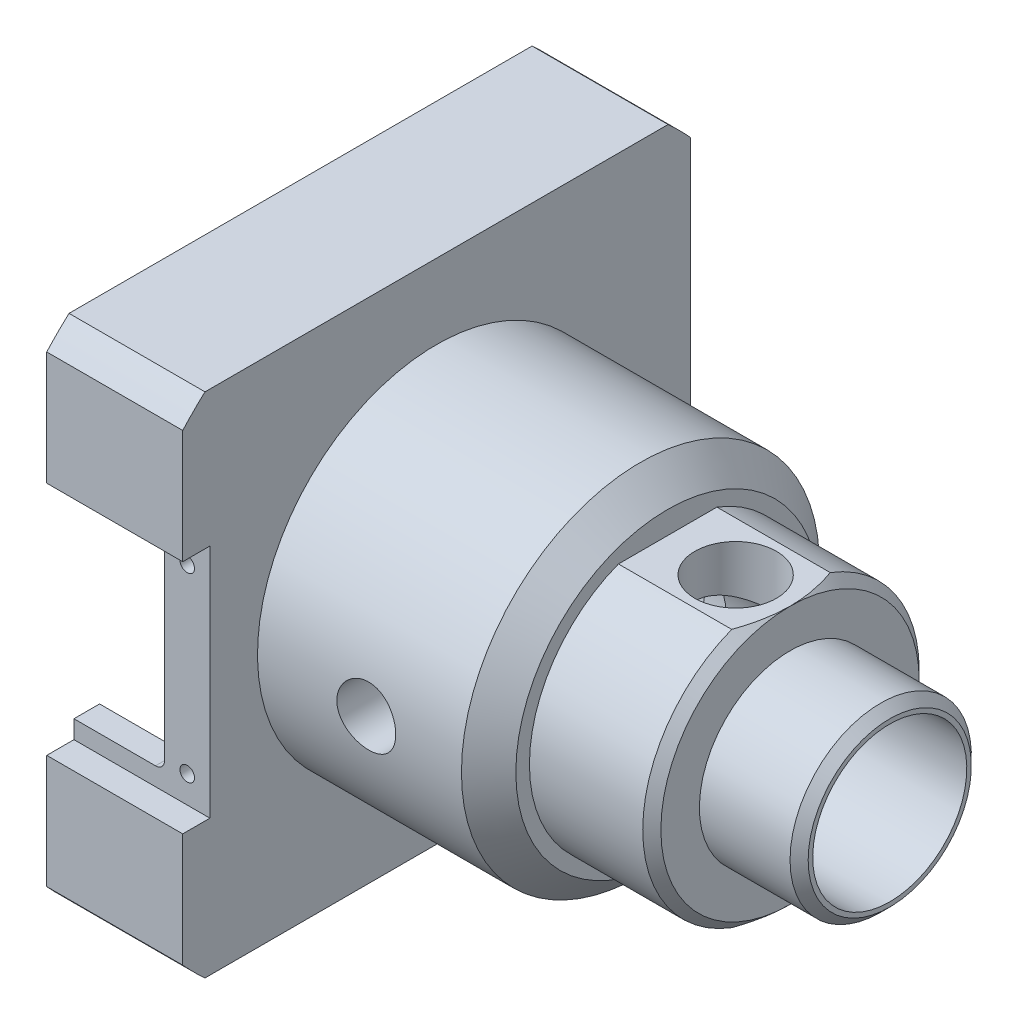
ISO-10303-21;
HEADER;
FILE_DESCRIPTION(('STEP AP214'),'2;1');
FILE_NAME('part.step','',(''),(''),'','','');
FILE_SCHEMA(('AUTOMOTIVE_DESIGN { 1 0 10303 214 1 1 1 1 }'));
ENDSEC;
DATA;
#1=APPLICATION_CONTEXT('core data for automotive mechanical design processes');
#2=APPLICATION_PROTOCOL_DEFINITION('international standard','automotive_design',2000,#1);
#3=PRODUCT_CONTEXT('',#1,'mechanical');
#4=PRODUCT('Part','Part','',(#3));
#5=PRODUCT_RELATED_PRODUCT_CATEGORY('part','',(#4));
#6=PRODUCT_DEFINITION_FORMATION('','',#4);
#7=PRODUCT_DEFINITION_CONTEXT('part definition',#1,'design');
#8=PRODUCT_DEFINITION('design','',#6,#7);
#9=PRODUCT_DEFINITION_SHAPE('','',#8);
#10=(LENGTH_UNIT() NAMED_UNIT(*) SI_UNIT(.MILLI.,.METRE.));
#11=(NAMED_UNIT(*) PLANE_ANGLE_UNIT() SI_UNIT($,.RADIAN.));
#12=(NAMED_UNIT(*) SI_UNIT($,.STERADIAN.) SOLID_ANGLE_UNIT());
#13=UNCERTAINTY_MEASURE_WITH_UNIT(LENGTH_MEASURE(1.E-05),#10,'distance_accuracy_value','');
#14=(GEOMETRIC_REPRESENTATION_CONTEXT(3) GLOBAL_UNCERTAINTY_ASSIGNED_CONTEXT((#13)) GLOBAL_UNIT_ASSIGNED_CONTEXT((#10,
#11,#12)) REPRESENTATION_CONTEXT('',''));
#15=CARTESIAN_POINT('',(0.,0.,0.));
#16=DIRECTION('',(0.,0.,1.));
#17=DIRECTION('',(1.,0.,0.));
#18=AXIS2_PLACEMENT_3D('',#15,#16,#17);
#19=CARTESIAN_POINT('',(64.,0.,0.));
#20=DIRECTION('',(-1.,0.,0.));
#21=DIRECTION('',(0.,0.,1.));
#22=AXIS2_PLACEMENT_3D('',#19,#20,#21);
#23=CONICAL_SURFACE('',#22,9.99999999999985,0.785398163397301);
#24=CARTESIAN_POINT('',(65.0000000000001,0.,0.));
#25=DIRECTION('',(-1.,0.,0.));
#26=DIRECTION('',(0.,0.,1.));
#27=AXIS2_PLACEMENT_3D('',#24,#25,#26);
#28=CIRCLE('',#27,9.00000000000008);
#29=CARTESIAN_POINT('',(65.0000000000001,0.,9.00000000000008));
#30=VERTEX_POINT('',#29);
#31=EDGE_CURVE('E18',#30,#30,#28,.T.);
#32=ORIENTED_EDGE('',*,*,#31,.T.);
#33=EDGE_LOOP('',(#32));
#34=FACE_BOUND('',#33,.T.);
#35=CARTESIAN_POINT('',(64.,0.,0.));
#36=DIRECTION('',(-1.,0.,0.));
#37=DIRECTION('',(0.,-1.,0.));
#38=AXIS2_PLACEMENT_3D('',#35,#36,#37);
#39=CIRCLE('',#38,10.);
#40=CARTESIAN_POINT('',(64.,-10.,0.));
#41=VERTEX_POINT('',#40);
#42=EDGE_CURVE('E255',#41,#41,#39,.T.);
#43=ORIENTED_EDGE('',*,*,#42,.F.);
#44=EDGE_LOOP('',(#43));
#45=FACE_BOUND('',#44,.T.);
#46=ADVANCED_FACE('F15',(#34,#45),#23,.T.);
#47=CARTESIAN_POINT('',(65.,0.,0.));
#48=DIRECTION('',(-1.,0.,0.));
#49=DIRECTION('',(0.,-1.,0.));
#50=AXIS2_PLACEMENT_3D('',#47,#48,#49);
#51=PLANE('',#50);
#52=ORIENTED_EDGE('',*,*,#31,.F.);
#53=EDGE_LOOP('',(#52));
#54=FACE_BOUND('',#53,.T.);
#55=CARTESIAN_POINT('',(65.,0.,0.));
#56=DIRECTION('',(-1.,0.,0.));
#57=DIRECTION('',(0.,-1.,0.));
#58=AXIS2_PLACEMENT_3D('',#55,#56,#57);
#59=CIRCLE('',#58,8.5);
#60=CARTESIAN_POINT('',(65.,-8.5,0.));
#61=VERTEX_POINT('',#60);
#62=EDGE_CURVE('E185',#61,#61,#59,.T.);
#63=ORIENTED_EDGE('',*,*,#62,.T.);
#64=EDGE_LOOP('',(#63));
#65=FACE_BOUND('',#64,.T.);
#66=ADVANCED_FACE('F1301',(#54,#65),#51,.F.);
#67=CARTESIAN_POINT('',(37.5,0.,0.));
#68=DIRECTION('',(-1.,0.,0.));
#69=DIRECTION('',(0.,-1.,0.));
#70=AXIS2_PLACEMENT_3D('',#67,#68,#69);
#71=PLANE('',#70);
#72=CARTESIAN_POINT('',(37.5,0.,0.));
#73=DIRECTION('',(-1.,0.,0.));
#74=DIRECTION('',(0.,-1.,0.));
#75=AXIS2_PLACEMENT_3D('',#72,#73,#74);
#76=CIRCLE('',#75,13.25);
#77=CARTESIAN_POINT('',(37.5,-13.25,0.));
#78=VERTEX_POINT('',#77);
#79=EDGE_CURVE('E259',#78,#78,#76,.T.);
#80=ORIENTED_EDGE('',*,*,#79,.T.);
#81=EDGE_LOOP('',(#80));
#82=FACE_BOUND('',#81,.T.);
#83=CARTESIAN_POINT('',(37.5,0.,0.));
#84=DIRECTION('',(-1.,0.,0.));
#85=DIRECTION('',(0.,-1.,0.));
#86=AXIS2_PLACEMENT_3D('',#83,#84,#85);
#87=CIRCLE('',#86,9.5);
#88=CARTESIAN_POINT('',(37.5,-9.5,0.));
#89=VERTEX_POINT('',#88);
#90=EDGE_CURVE('E265',#89,#89,#87,.F.);
#91=ORIENTED_EDGE('',*,*,#90,.T.);
#92=EDGE_LOOP('',(#91));
#93=FACE_BOUND('',#92,.T.);
#94=ADVANCED_FACE('F1293',(#82,#93),#71,.T.);
#95=CARTESIAN_POINT('',(51.,0.,0.));
#96=DIRECTION('',(-1.,0.,0.));
#97=DIRECTION('',(0.,-1.,0.));
#98=AXIS2_PLACEMENT_3D('',#95,#96,#97);
#99=PLANE('',#98);
#100=CARTESIAN_POINT('',(51.,0.,0.));
#101=DIRECTION('',(-1.,0.,0.));
#102=DIRECTION('',(0.,-1.,0.));
#103=AXIS2_PLACEMENT_3D('',#100,#101,#102);
#104=CIRCLE('',#103,9.5);
#105=CARTESIAN_POINT('',(51.,-8.88819441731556,3.35410196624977));
#106=VERTEX_POINT('',#105);
#107=CARTESIAN_POINT('',(51.,8.88819441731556,3.35410196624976));
#108=VERTEX_POINT('',#107);
#109=EDGE_CURVE('E268',#106,#108,#104,.T.);
#110=ORIENTED_EDGE('',*,*,#109,.T.);
#111=DIRECTION('',(0.,-1.,0.));
#112=VECTOR('',#111,1.);
#113=CARTESIAN_POINT('',(51.,0.,3.35410196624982));
#114=LINE('',#113,#112);
#115=CARTESIAN_POINT('',(51.,7.81024967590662,3.35410196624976));
#116=VERTEX_POINT('',#115);
#117=EDGE_CURVE('E183',#108,#116,#114,.T.);
#118=ORIENTED_EDGE('',*,*,#117,.T.);
#119=CARTESIAN_POINT('',(51.,0.,0.));
#120=DIRECTION('',(-1.,0.,0.));
#121=DIRECTION('',(0.,-1.,0.));
#122=AXIS2_PLACEMENT_3D('',#119,#120,#121);
#123=CIRCLE('',#122,8.5);
#124=CARTESIAN_POINT('',(51.,-7.81024967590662,3.35410196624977));
#125=VERTEX_POINT('',#124);
#126=EDGE_CURVE('E177',#116,#125,#123,.F.);
#127=ORIENTED_EDGE('',*,*,#126,.T.);
#128=DIRECTION('',(0.,-1.,0.));
#129=VECTOR('',#128,1.);
#130=CARTESIAN_POINT('',(51.,0.,3.35410196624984));
#131=LINE('',#130,#129);
#132=EDGE_CURVE('E181',#125,#106,#131,.T.);
#133=ORIENTED_EDGE('',*,*,#132,.T.);
#134=EDGE_LOOP('',(#110,#118,#127,#133));
#135=FACE_BOUND('',#134,.T.);
#136=ADVANCED_FACE('F180',(#135),#99,.T.);
#137=CARTESIAN_POINT('',(51.,0.,0.));
#138=DIRECTION('',(-1.,0.,0.));
#139=DIRECTION('',(0.,-1.,0.));
#140=AXIS2_PLACEMENT_3D('',#137,#138,#139);
#141=PLANE('',#140);
#142=CARTESIAN_POINT('',(51.,0.,0.));
#143=DIRECTION('',(-1.,0.,0.));
#144=DIRECTION('',(0.,-1.,0.));
#145=AXIS2_PLACEMENT_3D('',#142,#143,#144);
#146=CIRCLE('',#145,8.5);
#147=CARTESIAN_POINT('',(51.,-7.81024967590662,-3.35410196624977));
#148=VERTEX_POINT('',#147);
#149=CARTESIAN_POINT('',(51.,7.81024967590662,-3.35410196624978));
#150=VERTEX_POINT('',#149);
#151=EDGE_CURVE('E171',#148,#150,#146,.F.);
#152=ORIENTED_EDGE('',*,*,#151,.T.);
#153=DIRECTION('',(0.,-1.,0.));
#154=VECTOR('',#153,1.);
#155=CARTESIAN_POINT('',(51.,0.,-3.35410196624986));
#156=LINE('',#155,#154);
#157=CARTESIAN_POINT('',(51.,8.88819441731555,-3.35410196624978));
#158=VERTEX_POINT('',#157);
#159=EDGE_CURVE('E252',#150,#158,#156,.F.);
#160=ORIENTED_EDGE('',*,*,#159,.T.);
#161=CARTESIAN_POINT('',(51.,0.,0.));
#162=DIRECTION('',(-1.,0.,0.));
#163=DIRECTION('',(0.,-1.,0.));
#164=AXIS2_PLACEMENT_3D('',#161,#162,#163);
#165=CIRCLE('',#164,9.5);
#166=CARTESIAN_POINT('',(51.,-8.88819441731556,-3.35410196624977));
#167=VERTEX_POINT('',#166);
#168=EDGE_CURVE('E270',#158,#167,#165,.T.);
#169=ORIENTED_EDGE('',*,*,#168,.T.);
#170=DIRECTION('',(0.,-1.,0.));
#171=VECTOR('',#170,1.);
#172=CARTESIAN_POINT('',(51.,0.,-3.35410196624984));
#173=LINE('',#172,#171);
#174=EDGE_CURVE('E256',#167,#148,#173,.F.);
#175=ORIENTED_EDGE('',*,*,#174,.T.);
#176=EDGE_LOOP('',(#152,#160,#169,#175));
#177=FACE_BOUND('',#176,.T.);
#178=ADVANCED_FACE('F258',(#177),#141,.T.);
#179=CARTESIAN_POINT('',(68.25,0.,0.));
#180=DIRECTION('',(-1.,0.,0.));
#181=DIRECTION('',(0.,-1.,0.));
#182=AXIS2_PLACEMENT_3D('',#179,#180,#181);
#183=CYLINDRICAL_SURFACE('',#182,10.);
#184=ORIENTED_EDGE('',*,*,#42,.T.);
#185=EDGE_LOOP('',(#184));
#186=FACE_BOUND('',#185,.T.);
#187=CARTESIAN_POINT('',(54.,0.,0.));
#188=DIRECTION('',(-1.,0.,0.));
#189=DIRECTION('',(0.,-1.,0.));
#190=AXIS2_PLACEMENT_3D('',#187,#188,#189);
#191=CIRCLE('',#190,10.);
#192=CARTESIAN_POINT('',(54.,-10.,0.));
#193=VERTEX_POINT('',#192);
#194=EDGE_CURVE('E203',#193,#193,#191,.F.);
#195=ORIENTED_EDGE('',*,*,#194,.T.);
#196=EDGE_LOOP('',(#195));
#197=FACE_BOUND('',#196,.T.);
#198=ADVANCED_FACE('F274',(#186,#197),#183,.T.);
#199=CARTESIAN_POINT('',(68.25,0.,0.));
#200=DIRECTION('',(-1.,0.,0.));
#201=DIRECTION('',(0.,-1.,0.));
#202=AXIS2_PLACEMENT_3D('',#199,#200,#201);
#203=CYLINDRICAL_SURFACE('',#202,13.25);
#204=ORIENTED_EDGE('',*,*,#79,.F.);
#205=EDGE_LOOP('',(#204));
#206=FACE_BOUND('',#205,.T.);
#207=CARTESIAN_POINT('',(36.7,0.,0.));
#208=DIRECTION('',(-1.,0.,0.));
#209=DIRECTION('',(0.,-1.,0.));
#210=AXIS2_PLACEMENT_3D('',#207,#208,#209);
#211=CIRCLE('',#210,13.25);
#212=CARTESIAN_POINT('',(36.7,-13.25,0.));
#213=VERTEX_POINT('',#212);
#214=EDGE_CURVE('E198',#213,#213,#211,.T.);
#215=ORIENTED_EDGE('',*,*,#214,.T.);
#216=EDGE_LOOP('',(#215));
#217=FACE_BOUND('',#216,.T.);
#218=ADVANCED_FACE('F277',(#206,#217),#203,.F.);
#219=CARTESIAN_POINT('',(68.25,0.,0.));
#220=DIRECTION('',(-1.,0.,0.));
#221=DIRECTION('',(0.,-1.,0.));
#222=AXIS2_PLACEMENT_3D('',#219,#220,#221);
#223=CYLINDRICAL_SURFACE('',#222,8.5);
#224=ORIENTED_EDGE('',*,*,#62,.F.);
#225=EDGE_LOOP('',(#224));
#226=FACE_BOUND('',#225,.T.);
#227=CARTESIAN_POINT('',(50.9999999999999,-7.81024967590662,-3.35410196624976));
#228=CARTESIAN_POINT('',(51.0930919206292,-7.84601588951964,-3.27083619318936));
#229=CARTESIAN_POINT('',(51.1827102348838,-7.88185001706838,-3.18370443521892));
#230=CARTESIAN_POINT('',(51.3545567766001,-7.95279112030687,-3.00209705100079));
#231=CARTESIAN_POINT('',(51.4367822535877,-7.9878978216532,-2.90761871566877));
#232=CARTESIAN_POINT('',(51.5937046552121,-8.05665720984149,-2.71130058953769));
#233=CARTESIAN_POINT('',(51.6683637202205,-8.09030214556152,-2.60942777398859));
#234=CARTESIAN_POINT('',(51.8091654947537,-8.15511084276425,-2.39922043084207));
#235=CARTESIAN_POINT('',(51.8753091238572,-8.18627487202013,-2.29088660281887));
#236=CARTESIAN_POINT('',(51.9987250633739,-8.24541446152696,-2.06796482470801));
#237=CARTESIAN_POINT('',(52.0559686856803,-8.27337963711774,-1.95335819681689));
#238=CARTESIAN_POINT('',(52.1607497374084,-8.32524866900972,-1.71890790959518));
#239=CARTESIAN_POINT('',(52.2082879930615,-8.34915287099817,-1.59906469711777));
#240=CARTESIAN_POINT('',(52.2930103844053,-8.39217545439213,-1.3552416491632));
#241=CARTESIAN_POINT('',(52.3302175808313,-8.41130448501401,-1.23127172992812));
#242=CARTESIAN_POINT('',(52.3939220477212,-8.44427655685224,-0.979924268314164));
#243=CARTESIAN_POINT('',(52.4204204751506,-8.45812016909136,-0.852547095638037));
#244=CARTESIAN_POINT('',(52.4606274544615,-8.47920576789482,-0.605910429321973));
#245=CARTESIAN_POINT('',(52.4751978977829,-8.48689153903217,-0.486828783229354));
#246=CARTESIAN_POINT('',(52.4947805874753,-8.4972338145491,-0.247668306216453));
#247=CARTESIAN_POINT('',(52.4997935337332,-8.49989068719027,-0.127589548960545));
#248=CARTESIAN_POINT('',(52.5001939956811,-8.50010271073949,0.112607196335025));
#249=CARTESIAN_POINT('',(52.4955799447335,-8.49765703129,0.232725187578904));
#250=CARTESIAN_POINT('',(52.4767870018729,-8.48772988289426,0.471995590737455));
#251=CARTESIAN_POINT('',(52.462608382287,-8.48024855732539,0.591148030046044));
#252=CARTESIAN_POINT('',(52.4261104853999,-8.4611009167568,0.819787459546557));
#253=CARTESIAN_POINT('',(52.4043864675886,-8.44974144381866,0.929395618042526));
#254=CARTESIAN_POINT('',(52.3529918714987,-8.4230673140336,1.14625479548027));
#255=CARTESIAN_POINT('',(52.3233185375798,-8.40775128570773,1.25350498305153));
#256=CARTESIAN_POINT('',(52.2227898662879,-8.35634976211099,1.57071616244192));
#257=CARTESIAN_POINT('',(52.1404041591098,-8.31479904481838,1.77627142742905));
#258=CARTESIAN_POINT('',(51.9427759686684,-8.21813120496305,2.18129663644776));
#259=CARTESIAN_POINT('',(51.826035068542,-8.16241617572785,2.37987995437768));
#260=CARTESIAN_POINT('',(51.56511689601,-8.04342003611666,2.75537785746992));
#261=CARTESIAN_POINT('',(51.4209667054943,-7.980146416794,2.93231355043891));
#262=CARTESIAN_POINT('',(51.2223618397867,-7.89823595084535,3.14168603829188));
#263=CARTESIAN_POINT('',(51.1790657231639,-7.88066109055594,3.18548884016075));
#264=CARTESIAN_POINT('',(51.0907965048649,-7.84546915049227,3.27119975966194));
#265=CARTESIAN_POINT('',(51.0458261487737,-7.82785218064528,3.31311074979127));
#266=CARTESIAN_POINT('',(50.9999999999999,-7.81024967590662,3.35410196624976));
#267=B_SPLINE_CURVE_WITH_KNOTS('',3,(#227,#228,#229,#230,#231,#232,#233,#234,#235,#236,#237,
#238,#239,#240,#241,#242,#243,#244,#245,#246,#247,#248,#249,#250,#251,#252,#253,#254,#255,#256,
#257,#258,#259,#260,#261,#262,#263,#264,#265,#266),.UNSPECIFIED.,.F.,.F.,(4,2,2,2,2,2,2,2,2,2,2,
2,2,2,2,2,2,2,2,4),(0.,0.389660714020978,0.779465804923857,1.17113390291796,1.56275966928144,
1.95562273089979,2.34845233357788,2.74039789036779,3.13230109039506,3.49247084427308,
3.85261422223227,4.21281621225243,4.57300794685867,4.90956330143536,5.24623547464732,
5.91917683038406,6.62746183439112,7.33505061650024,7.52716409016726,7.71897531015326),.UNSPECIFIED.);
#268=EDGE_CURVE('E193',#148,#125,#267,.T.);
#269=ORIENTED_EDGE('',*,*,#268,.T.);
#270=ORIENTED_EDGE('',*,*,#126,.F.);
#271=CARTESIAN_POINT('',(50.9999999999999,7.81024967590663,3.35410196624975));
#272=CARTESIAN_POINT('',(51.0930919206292,7.84601588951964,3.27083619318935));
#273=CARTESIAN_POINT('',(51.1827102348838,7.88185001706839,3.18370443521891));
#274=CARTESIAN_POINT('',(51.3545567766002,7.95279112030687,3.00209705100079));
#275=CARTESIAN_POINT('',(51.4367822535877,7.98789782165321,2.90761871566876));
#276=CARTESIAN_POINT('',(51.5937046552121,8.05665720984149,2.71130058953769));
#277=CARTESIAN_POINT('',(51.6683637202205,8.09030214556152,2.60942777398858));
#278=CARTESIAN_POINT('',(51.8091654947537,8.15511084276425,2.39922043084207));
#279=CARTESIAN_POINT('',(51.8753091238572,8.18627487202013,2.29088660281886));
#280=CARTESIAN_POINT('',(51.9987250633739,8.24541446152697,2.067964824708));
#281=CARTESIAN_POINT('',(52.0559686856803,8.27337963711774,1.95335819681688));
#282=CARTESIAN_POINT('',(52.1607497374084,8.32524866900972,1.71890790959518));
#283=CARTESIAN_POINT('',(52.2082879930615,8.34915287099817,1.59906469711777));
#284=CARTESIAN_POINT('',(52.2930103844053,8.39217545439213,1.3552416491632));
#285=CARTESIAN_POINT('',(52.3302175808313,8.41130448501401,1.23127172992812));
#286=CARTESIAN_POINT('',(52.3939220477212,8.44427655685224,0.979924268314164));
#287=CARTESIAN_POINT('',(52.4204204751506,8.45812016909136,0.852547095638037));
#288=CARTESIAN_POINT('',(52.4606274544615,8.47920576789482,0.605910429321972));
#289=CARTESIAN_POINT('',(52.4751978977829,8.48689153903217,0.486828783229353));
#290=CARTESIAN_POINT('',(52.4947805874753,8.4972338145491,0.247668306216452));
#291=CARTESIAN_POINT('',(52.4997935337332,8.49989068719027,0.127589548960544));
#292=CARTESIAN_POINT('',(52.5001939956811,8.50010271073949,-0.112607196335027));
#293=CARTESIAN_POINT('',(52.4955799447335,8.49765703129,-0.232725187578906));
#294=CARTESIAN_POINT('',(52.4767870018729,8.48772988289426,-0.471995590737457));
#295=CARTESIAN_POINT('',(52.462608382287,8.48024855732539,-0.591148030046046));
#296=CARTESIAN_POINT('',(52.4261104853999,8.4611009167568,-0.81978745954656));
#297=CARTESIAN_POINT('',(52.4043864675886,8.44974144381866,-0.929395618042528));
#298=CARTESIAN_POINT('',(52.3529918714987,8.4230673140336,-1.14625479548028));
#299=CARTESIAN_POINT('',(52.3233185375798,8.40775128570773,-1.25350498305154));
#300=CARTESIAN_POINT('',(52.2227898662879,8.35634976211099,-1.57071616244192));
#301=CARTESIAN_POINT('',(52.1404041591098,8.31479904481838,-1.77627142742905));
#302=CARTESIAN_POINT('',(51.9427759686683,8.21813120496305,-2.18129663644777));
#303=CARTESIAN_POINT('',(51.826035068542,8.16241617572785,-2.37987995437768));
#304=CARTESIAN_POINT('',(51.56511689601,8.04342003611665,-2.75537785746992));
#305=CARTESIAN_POINT('',(51.4209667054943,7.980146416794,-2.93231355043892));
#306=CARTESIAN_POINT('',(51.2223618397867,7.89823595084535,-3.14168603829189));
#307=CARTESIAN_POINT('',(51.1790657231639,7.88066109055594,-3.18548884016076));
#308=CARTESIAN_POINT('',(51.0907965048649,7.84546915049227,-3.27119975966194));
#309=CARTESIAN_POINT('',(51.0458261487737,7.82785218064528,-3.31311074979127));
#310=CARTESIAN_POINT('',(50.9999999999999,7.81024967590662,-3.35410196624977));
#311=B_SPLINE_CURVE_WITH_KNOTS('',3,(#271,#272,#273,#274,#275,#276,#277,#278,#279,#280,#281,
#282,#283,#284,#285,#286,#287,#288,#289,#290,#291,#292,#293,#294,#295,#296,#297,#298,#299,#300,
#301,#302,#303,#304,#305,#306,#307,#308,#309,#310),.UNSPECIFIED.,.F.,.F.,(4,2,2,2,2,2,2,2,2,2,2,
2,2,2,2,2,2,2,2,4),(0.,0.389660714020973,0.779465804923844,1.17113390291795,1.56275966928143,
1.95562273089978,2.34845233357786,2.74039789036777,3.13230109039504,3.49247084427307,
3.85261422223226,4.21281621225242,4.57300794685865,4.90956330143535,5.24623547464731,
5.91917683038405,6.6274618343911,7.33505061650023,7.52716409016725,7.71897531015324),.UNSPECIFIED.);
#312=EDGE_CURVE('E200',#116,#150,#311,.T.);
#313=ORIENTED_EDGE('',*,*,#312,.T.);
#314=ORIENTED_EDGE('',*,*,#151,.F.);
#315=EDGE_LOOP('',(#269,#270,#313,#314));
#316=FACE_BOUND('',#315,.T.);
#317=ADVANCED_FACE('F197',(#226,#316),#223,.F.);
#318=CARTESIAN_POINT('',(68.25,0.,0.));
#319=DIRECTION('',(-1.,0.,0.));
#320=DIRECTION('',(0.,-1.,0.));
#321=AXIS2_PLACEMENT_3D('',#318,#319,#320);
#322=CYLINDRICAL_SURFACE('',#321,9.5);
#323=ORIENTED_EDGE('',*,*,#109,.F.);
#324=CARTESIAN_POINT('',(50.9999999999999,-8.88819441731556,3.35410196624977));
#325=CARTESIAN_POINT('',(50.9086478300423,-8.85736236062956,3.43581153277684));
#326=CARTESIAN_POINT('',(50.8139283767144,-8.82663799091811,3.51381143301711));
#327=CARTESIAN_POINT('',(50.6181865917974,-8.76619785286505,3.66199005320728));
#328=CARTESIAN_POINT('',(50.5171614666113,-8.73648254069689,3.73216526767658));
#329=CARTESIAN_POINT('',(50.3086162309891,-8.67868699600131,3.86466764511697));
#330=CARTESIAN_POINT('',(50.201056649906,-8.6506192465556,3.92693823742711));
#331=CARTESIAN_POINT('',(49.9806298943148,-8.59717778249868,4.04259736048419));
#332=CARTESIAN_POINT('',(49.8677632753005,-8.57180378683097,4.09598681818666));
#333=CARTESIAN_POINT('',(49.6368930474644,-8.52447112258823,4.19360812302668));
#334=CARTESIAN_POINT('',(49.5188709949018,-8.50252626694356,4.23780315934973));
#335=CARTESIAN_POINT('',(49.2789345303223,-8.46295974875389,4.31627681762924));
#336=CARTESIAN_POINT('',(49.1570223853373,-8.44533561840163,4.35056110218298));
#337=CARTESIAN_POINT('',(48.9107060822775,-8.41513592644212,4.40869110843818));
#338=CARTESIAN_POINT('',(48.7863155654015,-8.40253805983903,4.43258299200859));
#339=CARTESIAN_POINT('',(48.5356014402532,-8.38279674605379,4.46980631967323));
#340=CARTESIAN_POINT('',(48.4092794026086,-8.37564908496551,4.48314592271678));
#341=CARTESIAN_POINT('',(48.2355591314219,-8.36978323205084,4.49407777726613));
#342=CARTESIAN_POINT('',(48.1884929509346,-8.36859079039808,4.49629745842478));
#343=CARTESIAN_POINT('',(48.0942866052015,-8.36699896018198,4.49925898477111));
#344=CARTESIAN_POINT('',(48.0471464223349,-8.36659980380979,4.50000039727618));
#345=CARTESIAN_POINT('',(47.8818030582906,-8.36660142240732,4.49999900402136));
#346=CARTESIAN_POINT('',(47.7635669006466,-8.36911423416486,4.49533562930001));
#347=CARTESIAN_POINT('',(47.5279848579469,-8.37907667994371,4.47673777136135));
#348=CARTESIAN_POINT('',(47.4106395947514,-8.38652948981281,4.46279732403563));
#349=CARTESIAN_POINT('',(47.1775466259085,-8.40612420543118,4.42577859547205));
#350=CARTESIAN_POINT('',(47.06180259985,-8.41827549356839,4.40268202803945));
#351=CARTESIAN_POINT('',(46.8329607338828,-8.44683705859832,4.34763102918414));
#352=CARTESIAN_POINT('',(46.7198640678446,-8.46324918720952,4.31567274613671));
#353=CARTESIAN_POINT('',(46.3868891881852,-8.51789429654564,4.20738033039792));
#354=CARTESIAN_POINT('',(46.1718882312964,-8.56166760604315,4.11839533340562));
#355=CARTESIAN_POINT('',(45.7600483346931,-8.65893459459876,3.90973395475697));
#356=CARTESIAN_POINT('',(45.5632071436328,-8.7124270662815,3.79006138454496));
#357=CARTESIAN_POINT('',(45.1770771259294,-8.82793891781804,3.51306630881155));
#358=CARTESIAN_POINT('',(44.9894124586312,-8.89029614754,3.35361991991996));
#359=CARTESIAN_POINT('',(44.6421807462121,-9.01379849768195,3.00589223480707));
#360=CARTESIAN_POINT('',(44.4826272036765,-9.07494302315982,2.81759716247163));
#361=CARTESIAN_POINT('',(44.2631673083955,-9.16291961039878,2.51061816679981));
#362=CARTESIAN_POINT('',(44.1916663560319,-9.19237437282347,2.40079901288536));
#363=CARTESIAN_POINT('',(44.0582527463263,-9.24844323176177,2.17481527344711));
#364=CARTESIAN_POINT('',(43.9963360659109,-9.27505851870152,2.05865337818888));
#365=CARTESIAN_POINT('',(43.8826730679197,-9.32468590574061,1.82071607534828));
#366=CARTESIAN_POINT('',(43.8309268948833,-9.34769795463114,1.69894058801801));
#367=CARTESIAN_POINT('',(43.738194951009,-9.38942312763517,1.45070916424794));
#368=CARTESIAN_POINT('',(43.697203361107,-9.40813857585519,1.32425580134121));
#369=CARTESIAN_POINT('',(43.6287410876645,-9.43965268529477,1.07591790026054));
#370=CARTESIAN_POINT('',(43.6005685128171,-9.45275525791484,0.954265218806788));
#371=CARTESIAN_POINT('',(43.5544005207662,-9.47433043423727,0.708692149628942));
#372=CARTESIAN_POINT('',(43.5364002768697,-9.48280523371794,0.584772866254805));
#373=CARTESIAN_POINT('',(43.510789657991,-9.49488714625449,0.33565743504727));
#374=CARTESIAN_POINT('',(43.5031768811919,-9.49849538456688,0.210461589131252));
#375=CARTESIAN_POINT('',(43.4984343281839,-9.50074146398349,-0.0401701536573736));
#376=CARTESIAN_POINT('',(43.5013039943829,-9.49937956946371,-0.16560603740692));
#377=CARTESIAN_POINT('',(43.5168493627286,-9.49202818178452,-0.405819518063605));
#378=CARTESIAN_POINT('',(43.5287372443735,-9.48641051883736,-0.520660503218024));
#379=CARTESIAN_POINT('',(43.5612508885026,-9.4711291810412,-0.748862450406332));
#380=CARTESIAN_POINT('',(43.5818794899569,-9.46146419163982,-0.862222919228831));
#381=CARTESIAN_POINT('',(43.6316536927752,-9.43832414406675,-1.08662311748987));
#382=CARTESIAN_POINT('',(43.6607964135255,-9.42485037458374,-1.19766361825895));
#383=CARTESIAN_POINT('',(43.7273103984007,-9.39441380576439,-1.41677623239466));
#384=CARTESIAN_POINT('',(43.7646848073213,-9.3774496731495,-1.52484719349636));
#385=CARTESIAN_POINT('',(43.8898664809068,-9.32134713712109,-1.84667015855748));
#386=CARTESIAN_POINT('',(43.9900366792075,-9.27733396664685,-2.05491919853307));
#387=CARTESIAN_POINT('',(44.2197737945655,-9.18037588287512,-2.4520695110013));
#388=CARTESIAN_POINT('',(44.349350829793,-9.12742789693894,-2.64096409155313));
#389=CARTESIAN_POINT('',(44.6472273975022,-9.01224632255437,-3.01168799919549));
#390=CARTESIAN_POINT('',(44.8179145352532,-8.9496056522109,-3.19147409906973));
#391=CARTESIAN_POINT('',(45.1868631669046,-8.82517115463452,-3.52100007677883));
#392=CARTESIAN_POINT('',(45.3851475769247,-8.76337807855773,-3.67071472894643));
#393=CARTESIAN_POINT('',(45.7056284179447,-8.67483869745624,-3.87337280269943));
#394=CARTESIAN_POINT('',(45.8194680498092,-8.64533690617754,-3.9385997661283));
#395=CARTESIAN_POINT('',(46.0529932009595,-8.58941218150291,-4.05911390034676));
#396=CARTESIAN_POINT('',(46.1726760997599,-8.5629878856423,-4.11440547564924));
#397=CARTESIAN_POINT('',(46.4169494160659,-8.51420901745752,-4.21442072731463));
#398=CARTESIAN_POINT('',(46.5415315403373,-8.49184789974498,-4.25916143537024));
#399=CARTESIAN_POINT('',(46.7948206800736,-8.45203062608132,-4.33763916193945));
#400=CARTESIAN_POINT('',(46.9235258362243,-8.43457229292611,-4.37138106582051));
#401=CARTESIAN_POINT('',(47.2085187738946,-8.40254974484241,-4.43267272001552));
#402=CARTESIAN_POINT('',(47.3654513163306,-8.38914294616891,-4.45787320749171));
#403=CARTESIAN_POINT('',(47.6816028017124,-8.37117047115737,-4.4915342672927));
#404=CARTESIAN_POINT('',(47.8408214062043,-8.36660349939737,-4.49999729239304));
#405=CARTESIAN_POINT('',(48.1183171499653,-8.36659786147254,-4.50000201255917));
#406=CARTESIAN_POINT('',(48.2366121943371,-8.36911688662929,-4.49532976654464));
#407=CARTESIAN_POINT('',(48.4722976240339,-8.37909355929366,-4.47670717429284));
#408=CARTESIAN_POINT('',(48.5896877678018,-8.38655248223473,-4.46275443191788));
#409=CARTESIAN_POINT('',(48.8227616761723,-8.40615466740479,-4.42572049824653));
#410=CARTESIAN_POINT('',(48.9384432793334,-8.41830341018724,-4.40262862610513));
#411=CARTESIAN_POINT('',(49.1671624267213,-8.44685521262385,-4.34759563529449));
#412=CARTESIAN_POINT('',(49.2801989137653,-8.46325994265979,-4.31565104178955));
#413=CARTESIAN_POINT('',(49.6132009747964,-8.517908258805,-4.20735343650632));
#414=CARTESIAN_POINT('',(49.8282682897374,-8.56169667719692,-4.1183403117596));
#415=CARTESIAN_POINT('',(50.2401487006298,-8.6589890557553,-3.90960980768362));
#416=CARTESIAN_POINT('',(50.4369794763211,-8.7124834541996,-3.78992259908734));
#417=CARTESIAN_POINT('',(50.6886419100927,-8.78776820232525,-3.60939612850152));
#418=CARTESIAN_POINT('',(50.7529374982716,-8.80767305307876,-3.56059662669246));
#419=CARTESIAN_POINT('',(50.8786265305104,-8.84776558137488,-3.45976566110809));
#420=CARTESIAN_POINT('',(50.9400255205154,-8.86795261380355,-3.40774085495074));
#421=CARTESIAN_POINT('',(50.9999999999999,-8.88819441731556,-3.35410196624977));
#422=B_SPLINE_CURVE_WITH_KNOTS('',3,(#324,#325,#326,#327,#328,#329,#330,#331,#332,#333,#334,
#335,#336,#337,#338,#339,#340,#341,#342,#343,#344,#345,#346,#347,#348,#349,#350,#351,#352,#353,
#354,#355,#356,#357,#358,#359,#360,#361,#362,#363,#364,#365,#366,#367,#368,#369,#370,#371,#372,
#373,#374,#375,#376,#377,#378,#379,#380,#381,#382,#383,#384,#385,#386,#387,#388,#389,#390,#391,
#392,#393,#394,#395,#396,#397,#398,#399,#400,#401,#402,#403,#404,#405,#406,#407,#408,#409,#410,
#411,#412,#413,#414,#415,#416,#417,#418,#419,#420,#421),.UNSPECIFIED.,.F.,.F.,(4,2,2,2,2,2,2,2,
2,2,2,2,2,2,2,2,2,2,2,2,2,2,2,2,2,2,2,2,2,2,2,2,2,2,2,2,2,2,2,2,2,2,2,2,2,2,2,2,4),(0.,
0.379060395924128,0.758289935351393,1.14009646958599,1.52186312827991,1.90513000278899,
2.28817745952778,2.66950564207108,3.05053869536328,3.19191649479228,3.33333566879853,
3.68787612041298,4.04264472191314,4.39812545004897,4.75376092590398,5.46069961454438,
6.16755054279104,6.92646486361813,7.68574272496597,8.08824748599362,8.49058283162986,
8.8929238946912,9.29504680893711,9.6712167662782,10.0472080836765,10.4231124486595,
10.7989968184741,11.1453609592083,11.4918376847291,11.8381973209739,12.1846895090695,
12.8871834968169,13.5899195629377,14.353772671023,15.1182638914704,15.5212574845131,
15.9240719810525,16.3262317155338,16.7282125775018,17.2056074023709,17.6829322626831,
18.0377269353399,18.3926132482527,18.7479155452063,19.1033575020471,19.8105987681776,
20.5171470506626,20.7664685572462,21.0152915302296),.UNSPECIFIED.);
#423=EDGE_CURVE('E195',#106,#167,#422,.T.);
#424=ORIENTED_EDGE('',*,*,#423,.T.);
#425=ORIENTED_EDGE('',*,*,#168,.F.);
#426=CARTESIAN_POINT('',(50.9999999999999,8.88819441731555,-3.35410196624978));
#427=CARTESIAN_POINT('',(50.9086478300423,8.85736236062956,-3.43581153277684));
#428=CARTESIAN_POINT('',(50.8139283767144,8.82663799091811,-3.51381143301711));
#429=CARTESIAN_POINT('',(50.6181865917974,8.76619785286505,-3.66199005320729));
#430=CARTESIAN_POINT('',(50.5171614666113,8.73648254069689,-3.73216526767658));
#431=CARTESIAN_POINT('',(50.3086162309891,8.67868699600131,-3.86466764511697));
#432=CARTESIAN_POINT('',(50.201056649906,8.6506192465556,-3.92693823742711));
#433=CARTESIAN_POINT('',(49.9806298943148,8.59717778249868,-4.04259736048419));
#434=CARTESIAN_POINT('',(49.8677632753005,8.57180378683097,-4.09598681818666));
#435=CARTESIAN_POINT('',(49.6368930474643,8.52447112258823,-4.19360812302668));
#436=CARTESIAN_POINT('',(49.5188709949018,8.50252626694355,-4.23780315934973));
#437=CARTESIAN_POINT('',(49.2789345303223,8.46295974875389,-4.31627681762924));
#438=CARTESIAN_POINT('',(49.1570223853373,8.44533561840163,-4.35056110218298));
#439=CARTESIAN_POINT('',(48.9107060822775,8.41513592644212,-4.40869110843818));
#440=CARTESIAN_POINT('',(48.7863155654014,8.40253805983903,-4.43258299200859));
#441=CARTESIAN_POINT('',(48.5356014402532,8.38279674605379,-4.46980631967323));
#442=CARTESIAN_POINT('',(48.4092794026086,8.37564908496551,-4.48314592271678));
#443=CARTESIAN_POINT('',(48.2355591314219,8.36978323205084,-4.49407777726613));
#444=CARTESIAN_POINT('',(48.1884929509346,8.36859079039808,-4.49629745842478));
#445=CARTESIAN_POINT('',(48.0942866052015,8.36699896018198,-4.49925898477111));
#446=CARTESIAN_POINT('',(48.0471464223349,8.36659980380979,-4.50000039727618));
#447=CARTESIAN_POINT('',(47.8818030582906,8.36660142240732,-4.49999900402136));
#448=CARTESIAN_POINT('',(47.7635669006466,8.36911423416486,-4.49533562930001));
#449=CARTESIAN_POINT('',(47.5279848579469,8.37907667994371,-4.47673777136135));
#450=CARTESIAN_POINT('',(47.4106395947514,8.38652948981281,-4.46279732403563));
#451=CARTESIAN_POINT('',(47.1775466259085,8.40612420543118,-4.42577859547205));
#452=CARTESIAN_POINT('',(47.06180259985,8.41827549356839,-4.40268202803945));
#453=CARTESIAN_POINT('',(46.8329607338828,8.44683705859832,-4.34763102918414));
#454=CARTESIAN_POINT('',(46.7198640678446,8.46324918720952,-4.31567274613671));
#455=CARTESIAN_POINT('',(46.3868891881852,8.51789429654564,-4.20738033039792));
#456=CARTESIAN_POINT('',(46.1718882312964,8.56166760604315,-4.11839533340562));
#457=CARTESIAN_POINT('',(45.7600483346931,8.65893459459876,-3.90973395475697));
#458=CARTESIAN_POINT('',(45.5632071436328,8.7124270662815,-3.79006138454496));
#459=CARTESIAN_POINT('',(45.1770771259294,8.82793891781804,-3.51306630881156));
#460=CARTESIAN_POINT('',(44.9894124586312,8.89029614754,-3.35361991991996));
#461=CARTESIAN_POINT('',(44.6421807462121,9.01379849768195,-3.00589223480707));
#462=CARTESIAN_POINT('',(44.4826272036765,9.07494302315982,-2.81759716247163));
#463=CARTESIAN_POINT('',(44.2631673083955,9.16291961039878,-2.51061816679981));
#464=CARTESIAN_POINT('',(44.1916663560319,9.19237437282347,-2.40079901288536));
#465=CARTESIAN_POINT('',(44.0582527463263,9.24844323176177,-2.17481527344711));
#466=CARTESIAN_POINT('',(43.9963360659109,9.27505851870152,-2.05865337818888));
#467=CARTESIAN_POINT('',(43.8826730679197,9.32468590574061,-1.82071607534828));
#468=CARTESIAN_POINT('',(43.8309268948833,9.34769795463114,-1.69894058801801));
#469=CARTESIAN_POINT('',(43.738194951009,9.38942312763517,-1.45070916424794));
#470=CARTESIAN_POINT('',(43.697203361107,9.40813857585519,-1.32425580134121));
#471=CARTESIAN_POINT('',(43.6287410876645,9.43965268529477,-1.07591790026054));
#472=CARTESIAN_POINT('',(43.6005685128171,9.45275525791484,-0.954265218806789));
#473=CARTESIAN_POINT('',(43.5544005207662,9.47433043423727,-0.708692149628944));
#474=CARTESIAN_POINT('',(43.5364002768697,9.48280523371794,-0.584772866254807));
#475=CARTESIAN_POINT('',(43.510789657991,9.4948871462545,-0.335657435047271));
#476=CARTESIAN_POINT('',(43.5031768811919,9.49849538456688,-0.210461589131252));
#477=CARTESIAN_POINT('',(43.4984343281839,9.50074146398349,0.0401701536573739));
#478=CARTESIAN_POINT('',(43.5013039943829,9.49937956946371,0.16560603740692));
#479=CARTESIAN_POINT('',(43.5168493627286,9.49202818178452,0.405819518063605));
#480=CARTESIAN_POINT('',(43.5287372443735,9.48641051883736,0.520660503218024));
#481=CARTESIAN_POINT('',(43.5612508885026,9.4711291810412,0.748862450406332));
#482=CARTESIAN_POINT('',(43.5818794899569,9.46146419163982,0.862222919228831));
#483=CARTESIAN_POINT('',(43.6316536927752,9.43832414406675,1.08662311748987));
#484=CARTESIAN_POINT('',(43.6607964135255,9.42485037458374,1.19766361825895));
#485=CARTESIAN_POINT('',(43.7273103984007,9.39441380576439,1.41677623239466));
#486=CARTESIAN_POINT('',(43.7646848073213,9.3774496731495,1.52484719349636));
#487=CARTESIAN_POINT('',(43.8898664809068,9.32134713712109,1.84667015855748));
#488=CARTESIAN_POINT('',(43.9900366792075,9.27733396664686,2.05491919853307));
#489=CARTESIAN_POINT('',(44.2197737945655,9.18037588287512,2.4520695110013));
#490=CARTESIAN_POINT('',(44.349350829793,9.12742789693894,2.64096409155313));
#491=CARTESIAN_POINT('',(44.6472273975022,9.01224632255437,3.01168799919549));
#492=CARTESIAN_POINT('',(44.8179145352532,8.9496056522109,3.19147409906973));
#493=CARTESIAN_POINT('',(45.1868631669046,8.82517115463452,3.52100007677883));
#494=CARTESIAN_POINT('',(45.3851475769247,8.76337807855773,3.67071472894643));
#495=CARTESIAN_POINT('',(45.7056284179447,8.67483869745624,3.87337280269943));
#496=CARTESIAN_POINT('',(45.8194680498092,8.64533690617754,3.9385997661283));
#497=CARTESIAN_POINT('',(46.0529932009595,8.58941218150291,4.05911390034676));
#498=CARTESIAN_POINT('',(46.1726760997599,8.5629878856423,4.11440547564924));
#499=CARTESIAN_POINT('',(46.4169494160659,8.51420901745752,4.21442072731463));
#500=CARTESIAN_POINT('',(46.5415315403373,8.49184789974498,4.25916143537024));
#501=CARTESIAN_POINT('',(46.7948206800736,8.45203062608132,4.33763916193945));
#502=CARTESIAN_POINT('',(46.9235258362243,8.43457229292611,4.37138106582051));
#503=CARTESIAN_POINT('',(47.2085187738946,8.40254974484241,4.43267272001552));
#504=CARTESIAN_POINT('',(47.3654513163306,8.38914294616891,4.45787320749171));
#505=CARTESIAN_POINT('',(47.6816028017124,8.37117047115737,4.4915342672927));
#506=CARTESIAN_POINT('',(47.8408214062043,8.36660349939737,4.49999729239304));
#507=CARTESIAN_POINT('',(48.1183171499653,8.36659786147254,4.50000201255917));
#508=CARTESIAN_POINT('',(48.2366121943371,8.36911688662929,4.49532976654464));
#509=CARTESIAN_POINT('',(48.4722976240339,8.37909355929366,4.47670717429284));
#510=CARTESIAN_POINT('',(48.5896877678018,8.38655248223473,4.46275443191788));
#511=CARTESIAN_POINT('',(48.8227616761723,8.40615466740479,4.42572049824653));
#512=CARTESIAN_POINT('',(48.9384432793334,8.41830341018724,4.40262862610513));
#513=CARTESIAN_POINT('',(49.1671624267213,8.44685521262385,4.34759563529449));
#514=CARTESIAN_POINT('',(49.2801989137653,8.46325994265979,4.31565104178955));
#515=CARTESIAN_POINT('',(49.6132009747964,8.517908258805,4.20735343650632));
#516=CARTESIAN_POINT('',(49.8282682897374,8.56169667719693,4.1183403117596));
#517=CARTESIAN_POINT('',(50.2401487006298,8.6589890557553,3.90960980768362));
#518=CARTESIAN_POINT('',(50.4369794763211,8.7124834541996,3.78992259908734));
#519=CARTESIAN_POINT('',(50.6886419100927,8.78776820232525,3.60939612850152));
#520=CARTESIAN_POINT('',(50.7529374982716,8.80767305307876,3.56059662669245));
#521=CARTESIAN_POINT('',(50.8786265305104,8.84776558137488,3.45976566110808));
#522=CARTESIAN_POINT('',(50.9400255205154,8.86795261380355,3.40774085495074));
#523=CARTESIAN_POINT('',(50.9999999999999,8.88819441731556,3.35410196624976));
#524=B_SPLINE_CURVE_WITH_KNOTS('',3,(#426,#427,#428,#429,#430,#431,#432,#433,#434,#435,#436,
#437,#438,#439,#440,#441,#442,#443,#444,#445,#446,#447,#448,#449,#450,#451,#452,#453,#454,#455,
#456,#457,#458,#459,#460,#461,#462,#463,#464,#465,#466,#467,#468,#469,#470,#471,#472,#473,#474,
#475,#476,#477,#478,#479,#480,#481,#482,#483,#484,#485,#486,#487,#488,#489,#490,#491,#492,#493,
#494,#495,#496,#497,#498,#499,#500,#501,#502,#503,#504,#505,#506,#507,#508,#509,#510,#511,#512,
#513,#514,#515,#516,#517,#518,#519,#520,#521,#522,#523),.UNSPECIFIED.,.F.,.F.,(4,2,2,2,2,2,2,2,
2,2,2,2,2,2,2,2,2,2,2,2,2,2,2,2,2,2,2,2,2,2,2,2,2,2,2,2,2,2,2,2,2,2,2,2,2,2,2,2,4),(0.,
0.379060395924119,0.758289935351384,1.14009646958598,1.5218631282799,1.905130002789,
2.28817745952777,2.66950564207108,3.05053869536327,3.19191649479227,3.33333566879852,
3.68787612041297,4.04264472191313,4.39812545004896,4.75376092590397,5.46069961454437,
6.16755054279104,6.92646486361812,7.68574272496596,8.08824748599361,8.49058283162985,
8.89292389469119,9.2950468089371,9.67121676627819,10.0472080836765,10.4231124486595,
10.798996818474,11.1453609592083,11.4918376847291,11.8381973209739,12.1846895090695,
12.8871834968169,13.5899195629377,14.353772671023,15.1182638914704,15.5212574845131,
15.9240719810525,16.3262317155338,16.7282125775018,17.2056074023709,17.6829322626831,
18.0377269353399,18.3926132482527,18.7479155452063,19.1033575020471,19.8105987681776,
20.5171470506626,20.7664685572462,21.0152915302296),.UNSPECIFIED.);
#525=EDGE_CURVE('E239',#158,#108,#524,.T.);
#526=ORIENTED_EDGE('',*,*,#525,.T.);
#527=EDGE_LOOP('',(#323,#424,#425,#526));
#528=FACE_BOUND('',#527,.T.);
#529=ORIENTED_EDGE('',*,*,#90,.F.);
#530=EDGE_LOOP('',(#529));
#531=FACE_BOUND('',#530,.T.);
#532=ADVANCED_FACE('F232',(#528,#531),#322,.F.);
#533=CARTESIAN_POINT('',(54.,0.,0.));
#534=DIRECTION('',(-1.,0.,0.));
#535=DIRECTION('',(0.,-1.,0.));
#536=AXIS2_PLACEMENT_3D('',#533,#534,#535);
#537=PLANE('',#536);
#538=CARTESIAN_POINT('',(54.0000000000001,0.,0.));
#539=DIRECTION('',(-1.,0.,0.));
#540=DIRECTION('',(0.,0.,1.));
#541=AXIS2_PLACEMENT_3D('',#538,#539,#540);
#542=CIRCLE('',#541,14.25);
#543=CARTESIAN_POINT('',(54.0000000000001,14.25,0.));
#544=VERTEX_POINT('',#543);
#545=CARTESIAN_POINT('',(54.0000000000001,-14.25,0.));
#546=VERTEX_POINT('',#545);
#547=EDGE_CURVE('E244',#544,#546,#542,.T.);
#548=ORIENTED_EDGE('',*,*,#547,.F.);
#549=CARTESIAN_POINT('',(54.0000000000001,0.,0.));
#550=DIRECTION('',(-1.,0.,0.));
#551=DIRECTION('',(0.,-1.,0.));
#552=AXIS2_PLACEMENT_3D('',#549,#550,#551);
#553=CIRCLE('',#552,14.2500000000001);
#554=EDGE_CURVE('E502',#546,#544,#553,.T.);
#555=ORIENTED_EDGE('',*,*,#554,.F.);
#556=EDGE_LOOP('',(#548,#555));
#557=FACE_BOUND('',#556,.T.);
#558=ORIENTED_EDGE('',*,*,#194,.F.);
#559=EDGE_LOOP('',(#558));
#560=FACE_BOUND('',#559,.T.);
#561=ADVANCED_FACE('F229',(#557,#560),#537,.F.);
#562=CARTESIAN_POINT('',(36.7,0.,0.));
#563=DIRECTION('',(-1.,0.,0.));
#564=DIRECTION('',(0.,-1.,0.));
#565=AXIS2_PLACEMENT_3D('',#562,#563,#564);
#566=PLANE('',#565);
#567=ORIENTED_EDGE('',*,*,#214,.F.);
#568=EDGE_LOOP('',(#567));
#569=FACE_BOUND('',#568,.T.);
#570=CARTESIAN_POINT('',(36.7,0.,0.));
#571=DIRECTION('',(-1.,0.,0.));
#572=DIRECTION('',(0.,-1.,0.));
#573=AXIS2_PLACEMENT_3D('',#570,#571,#572);
#574=CIRCLE('',#573,12.75);
#575=CARTESIAN_POINT('',(36.7,-12.75,0.));
#576=VERTEX_POINT('',#575);
#577=EDGE_CURVE('E500',#576,#576,#574,.T.);
#578=ORIENTED_EDGE('',*,*,#577,.T.);
#579=EDGE_LOOP('',(#578));
#580=FACE_BOUND('',#579,.T.);
#581=ADVANCED_FACE('F223',(#569,#580),#566,.F.);
#582=CARTESIAN_POINT('',(48.,-45.48,0.));
#583=DIRECTION('',(0.,1.,0.));
#584=DIRECTION('',(0.,0.,1.));
#585=AXIS2_PLACEMENT_3D('',#582,#583,#584);
#586=CYLINDRICAL_SURFACE('',#585,4.5);
#587=ORIENTED_EDGE('',*,*,#423,.F.);
#588=ORIENTED_EDGE('',*,*,#132,.F.);
#589=ORIENTED_EDGE('',*,*,#268,.F.);
#590=ORIENTED_EDGE('',*,*,#174,.F.);
#591=EDGE_LOOP('',(#587,#588,#589,#590));
#592=FACE_BOUND('',#591,.T.);
#593=CARTESIAN_POINT('',(48.,-14.25,0.));
#594=DIRECTION('',(0.,1.,0.));
#595=DIRECTION('',(0.,0.,1.));
#596=AXIS2_PLACEMENT_3D('',#593,#594,#595);
#597=CIRCLE('',#596,4.5);
#598=CARTESIAN_POINT('',(48.,-14.25,4.5));
#599=VERTEX_POINT('',#598);
#600=EDGE_CURVE('E476',#599,#599,#597,.F.);
#601=ORIENTED_EDGE('',*,*,#600,.T.);
#602=EDGE_LOOP('',(#601));
#603=FACE_BOUND('',#602,.T.);
#604=ADVANCED_FACE('F190',(#592,#603),#586,.F.);
#605=CARTESIAN_POINT('',(48.,-45.48,0.));
#606=DIRECTION('',(0.,1.,0.));
#607=DIRECTION('',(0.,0.,1.));
#608=AXIS2_PLACEMENT_3D('',#605,#606,#607);
#609=CYLINDRICAL_SURFACE('',#608,4.5);
#610=ORIENTED_EDGE('',*,*,#117,.F.);
#611=ORIENTED_EDGE('',*,*,#525,.F.);
#612=ORIENTED_EDGE('',*,*,#159,.F.);
#613=ORIENTED_EDGE('',*,*,#312,.F.);
#614=EDGE_LOOP('',(#610,#611,#612,#613));
#615=FACE_BOUND('',#614,.T.);
#616=CARTESIAN_POINT('',(48.,14.25,0.));
#617=DIRECTION('',(0.,1.,0.));
#618=DIRECTION('',(0.,0.,1.));
#619=AXIS2_PLACEMENT_3D('',#616,#617,#618);
#620=CIRCLE('',#619,4.5);
#621=CARTESIAN_POINT('',(48.,14.25,4.5));
#622=VERTEX_POINT('',#621);
#623=EDGE_CURVE('E682',#622,#622,#620,.T.);
#624=ORIENTED_EDGE('',*,*,#623,.T.);
#625=EDGE_LOOP('',(#624));
#626=FACE_BOUND('',#625,.T.);
#627=ADVANCED_FACE('F222',(#615,#626),#609,.F.);
#628=CARTESIAN_POINT('',(52.9999999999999,0.,0.));
#629=DIRECTION('',(-1.,0.,0.));
#630=DIRECTION('',(0.,0.,1.));
#631=AXIS2_PLACEMENT_3D('',#628,#629,#630);
#632=CONICAL_SURFACE('',#631,15.25,0.785398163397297);
#633=CARTESIAN_POINT('',(52.9999999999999,14.25,-5.43139024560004));
#634=CARTESIAN_POINT('',(53.0778275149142,14.25,-5.21285389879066));
#635=CARTESIAN_POINT('',(53.1520169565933,14.25,-4.99304059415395));
#636=CARTESIAN_POINT('',(53.2924445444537,14.25,-4.55082625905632));
#637=CARTESIAN_POINT('',(53.3586805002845,14.25,-4.32842453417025));
#638=CARTESIAN_POINT('',(53.5434269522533,14.25,-3.6609229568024));
#639=CARTESIAN_POINT('',(53.6491993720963,14.25,-3.2121479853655));
#640=CARTESIAN_POINT('',(53.7782913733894,14.25,-2.53326206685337));
#641=CARTESIAN_POINT('',(53.8164076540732,14.25,-2.3058805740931));
#642=CARTESIAN_POINT('',(53.8822383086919,14.25,-1.84959706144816));
#643=CARTESIAN_POINT('',(53.9099528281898,14.25,-1.62069506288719));
#644=CARTESIAN_POINT('',(53.9547020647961,14.25,-1.16013060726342));
#645=CARTESIAN_POINT('',(53.9716559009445,14.25,-0.92846027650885));
#646=CARTESIAN_POINT('',(53.9943218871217,14.25,-0.4645306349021));
#647=CARTESIAN_POINT('',(54.0000320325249,14.25,-0.232271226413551));
#648=CARTESIAN_POINT('',(54.0000000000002,14.25,0.));
#649=B_SPLINE_CURVE_WITH_KNOTS('',3,(#633,#634,#635,#636,#637,#638,#639,#640,#641,#642,#643,
#644,#645,#646,#647,#648),.UNSPECIFIED.,.F.,.F.,(4,2,2,2,2,2,2,4),(0.,0.695863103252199,
1.39191740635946,2.77327107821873,3.46474286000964,4.15620496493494,4.8528046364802,
5.54952849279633),.UNSPECIFIED.);
#650=CARTESIAN_POINT('',(52.9999999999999,14.25,-5.43139024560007));
#651=VERTEX_POINT('',#650);
#652=EDGE_CURVE('E442',#651,#544,#649,.T.);
#653=ORIENTED_EDGE('',*,*,#652,.T.);
#654=ORIENTED_EDGE('',*,*,#547,.T.);
#655=CARTESIAN_POINT('',(54.0000000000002,-14.25,0.));
#656=CARTESIAN_POINT('',(54.0000320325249,-14.25,-0.23227122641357));
#657=CARTESIAN_POINT('',(53.9943218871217,-14.25,-0.464530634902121));
#658=CARTESIAN_POINT('',(53.9716559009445,-14.25,-0.928460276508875));
#659=CARTESIAN_POINT('',(53.9547020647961,-14.25,-1.16013060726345));
#660=CARTESIAN_POINT('',(53.9099528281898,-14.25,-1.62069506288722));
#661=CARTESIAN_POINT('',(53.8822383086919,-14.25,-1.8495970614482));
#662=CARTESIAN_POINT('',(53.8164076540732,-14.25,-2.30588057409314));
#663=CARTESIAN_POINT('',(53.7782913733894,-14.25,-2.53326206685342));
#664=CARTESIAN_POINT('',(53.6491993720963,-14.25,-3.21214798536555));
#665=CARTESIAN_POINT('',(53.5434269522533,-14.25,-3.66092295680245));
#666=CARTESIAN_POINT('',(53.3586805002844,-14.25,-4.32842453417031));
#667=CARTESIAN_POINT('',(53.2924445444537,-14.25,-4.55082625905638));
#668=CARTESIAN_POINT('',(53.1520169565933,-14.25,-4.99304059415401));
#669=CARTESIAN_POINT('',(53.0778275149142,-14.25,-5.21285389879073));
#670=CARTESIAN_POINT('',(52.9999999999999,-14.25,-5.43139024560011));
#671=B_SPLINE_CURVE_WITH_KNOTS('',3,(#655,#656,#657,#658,#659,#660,#661,#662,#663,#664,#665,
#666,#667,#668,#669,#670),.UNSPECIFIED.,.F.,.F.,(4,2,2,2,2,2,2,4),(0.,0.696723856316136,
1.39332352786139,2.0847856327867,2.77625741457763,4.15761108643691,4.85366538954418,
5.54952849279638),.UNSPECIFIED.);
#672=CARTESIAN_POINT('',(52.9999999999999,-14.25,-5.43139024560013));
#673=VERTEX_POINT('',#672);
#674=EDGE_CURVE('E475',#546,#673,#671,.T.);
#675=ORIENTED_EDGE('',*,*,#674,.T.);
#676=CARTESIAN_POINT('',(53.,0.,0.));
#677=DIRECTION('',(-1.,0.,0.));
#678=DIRECTION('',(0.,-1.,0.));
#679=AXIS2_PLACEMENT_3D('',#676,#677,#678);
#680=CIRCLE('',#679,15.25);
#681=EDGE_CURVE('E529',#651,#673,#680,.T.);
#682=ORIENTED_EDGE('',*,*,#681,.F.);
#683=EDGE_LOOP('',(#653,#654,#675,#682));
#684=FACE_BOUND('',#683,.T.);
#685=ADVANCED_FACE('F463',(#684),#632,.T.);
#686=CARTESIAN_POINT('',(52.9999999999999,0.,0.));
#687=DIRECTION('',(-1.,0.,0.));
#688=DIRECTION('',(0.,-1.,0.));
#689=AXIS2_PLACEMENT_3D('',#686,#687,#688);
#690=CONICAL_SURFACE('',#689,15.2499999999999,0.785398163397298);
#691=CARTESIAN_POINT('',(54.0000000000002,14.25,0.));
#692=CARTESIAN_POINT('',(54.0000320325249,14.25,0.23227122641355));
#693=CARTESIAN_POINT('',(53.9943218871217,14.25,0.464530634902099));
#694=CARTESIAN_POINT('',(53.9716559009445,14.25,0.928460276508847));
#695=CARTESIAN_POINT('',(53.9547020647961,14.25,1.16013060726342));
#696=CARTESIAN_POINT('',(53.9099528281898,14.25,1.62069506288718));
#697=CARTESIAN_POINT('',(53.8822383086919,14.25,1.84959706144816));
#698=CARTESIAN_POINT('',(53.8164076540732,14.25,2.30588057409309));
#699=CARTESIAN_POINT('',(53.7782913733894,14.25,2.53326206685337));
#700=CARTESIAN_POINT('',(53.6491993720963,14.25,3.21214798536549));
#701=CARTESIAN_POINT('',(53.5434269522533,14.25,3.66092295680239));
#702=CARTESIAN_POINT('',(53.3586805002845,14.25,4.32842453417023));
#703=CARTESIAN_POINT('',(53.2924445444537,14.25,4.5508262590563));
#704=CARTESIAN_POINT('',(53.1520169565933,14.25,4.99304059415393));
#705=CARTESIAN_POINT('',(53.0778275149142,14.25,5.21285389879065));
#706=CARTESIAN_POINT('',(52.9999999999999,14.25,5.43139024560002));
#707=B_SPLINE_CURVE_WITH_KNOTS('',3,(#691,#692,#693,#694,#695,#696,#697,#698,#699,#700,#701,
#702,#703,#704,#705,#706),.UNSPECIFIED.,.F.,.F.,(4,2,2,2,2,2,2,4),(0.,0.696723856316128,
1.39332352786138,2.08478563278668,2.77625741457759,4.15761108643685,4.85366538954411,
5.54952849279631),.UNSPECIFIED.);
#708=CARTESIAN_POINT('',(52.9999999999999,14.25,5.43139024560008));
#709=VERTEX_POINT('',#708);
#710=EDGE_CURVE('E448',#544,#709,#707,.T.);
#711=ORIENTED_EDGE('',*,*,#710,.T.);
#712=CARTESIAN_POINT('',(53.,0.,0.));
#713=DIRECTION('',(-1.,0.,0.));
#714=DIRECTION('',(0.,-1.,0.));
#715=AXIS2_PLACEMENT_3D('',#712,#713,#714);
#716=CIRCLE('',#715,15.25);
#717=CARTESIAN_POINT('',(52.9999999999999,-14.25,5.43139024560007));
#718=VERTEX_POINT('',#717);
#719=EDGE_CURVE('E517',#718,#709,#716,.T.);
#720=ORIENTED_EDGE('',*,*,#719,.F.);
#721=CARTESIAN_POINT('',(52.9999999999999,-14.25,5.43139024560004));
#722=CARTESIAN_POINT('',(53.0778275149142,-14.25,5.21285389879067));
#723=CARTESIAN_POINT('',(53.1520169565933,-14.25,4.99304059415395));
#724=CARTESIAN_POINT('',(53.2924445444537,-14.25,4.55082625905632));
#725=CARTESIAN_POINT('',(53.3586805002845,-14.25,4.32842453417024));
#726=CARTESIAN_POINT('',(53.5434269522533,-14.25,3.6609229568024));
#727=CARTESIAN_POINT('',(53.6491993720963,-14.25,3.21214798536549));
#728=CARTESIAN_POINT('',(53.7782913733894,-14.25,2.53326206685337));
#729=CARTESIAN_POINT('',(53.8164076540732,-14.25,2.30588057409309));
#730=CARTESIAN_POINT('',(53.8822383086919,-14.25,1.84959706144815));
#731=CARTESIAN_POINT('',(53.9099528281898,-14.25,1.62069506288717));
#732=CARTESIAN_POINT('',(53.9547020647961,-14.25,1.16013060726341));
#733=CARTESIAN_POINT('',(53.9716559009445,-14.25,0.928460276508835));
#734=CARTESIAN_POINT('',(53.9943218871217,-14.25,0.464530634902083));
#735=CARTESIAN_POINT('',(54.000032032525,-14.25,0.232271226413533));
#736=CARTESIAN_POINT('',(54.0000000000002,-14.25,0.));
#737=B_SPLINE_CURVE_WITH_KNOTS('',3,(#721,#722,#723,#724,#725,#726,#727,#728,#729,#730,#731,
#732,#733,#734,#735,#736),.UNSPECIFIED.,.F.,.F.,(4,2,2,2,2,2,2,4),(0.,0.695863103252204,
1.39191740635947,2.77327107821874,3.46474286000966,4.15620496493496,4.85280463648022,
5.54952849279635),.UNSPECIFIED.);
#738=EDGE_CURVE('E468',#718,#546,#737,.T.);
#739=ORIENTED_EDGE('',*,*,#738,.T.);
#740=ORIENTED_EDGE('',*,*,#554,.T.);
#741=EDGE_LOOP('',(#711,#720,#739,#740));
#742=FACE_BOUND('',#741,.T.);
#743=ADVANCED_FACE('F458',(#742),#690,.T.);
#744=CARTESIAN_POINT('',(68.25,0.,0.));
#745=DIRECTION('',(-1.,0.,0.));
#746=DIRECTION('',(0.,-1.,0.));
#747=AXIS2_PLACEMENT_3D('',#744,#745,#746);
#748=CYLINDRICAL_SURFACE('',#747,12.75);
#749=ORIENTED_EDGE('',*,*,#577,.F.);
#750=EDGE_LOOP('',(#749));
#751=FACE_BOUND('',#750,.T.);
#752=CARTESIAN_POINT('',(32.,0.,0.));
#753=DIRECTION('',(-1.,0.,0.));
#754=DIRECTION('',(0.,-1.,0.));
#755=AXIS2_PLACEMENT_3D('',#752,#753,#754);
#756=CIRCLE('',#755,12.75);
#757=CARTESIAN_POINT('',(32.,-12.75,0.));
#758=VERTEX_POINT('',#757);
#759=EDGE_CURVE('E456',#758,#758,#756,.F.);
#760=ORIENTED_EDGE('',*,*,#759,.F.);
#761=EDGE_LOOP('',(#760));
#762=FACE_BOUND('',#761,.T.);
#763=ADVANCED_FACE('F462',(#751,#762),#748,.F.);
#764=CARTESIAN_POINT('',(40.5,-14.25,-33.6));
#765=DIRECTION('',(0.,1.,0.));
#766=DIRECTION('',(0.,0.,1.));
#767=AXIS2_PLACEMENT_3D('',#764,#765,#766);
#768=PLANE('',#767);
#769=DIRECTION('',(0.,0.,1.));
#770=VECTOR('',#769,1.);
#771=CARTESIAN_POINT('',(40.5,-14.25,0.));
#772=LINE('',#771,#770);
#773=CARTESIAN_POINT('',(40.5,-14.25,5.43139024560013));
#774=VERTEX_POINT('',#773);
#775=CARTESIAN_POINT('',(40.5,-14.25,-5.43139024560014));
#776=VERTEX_POINT('',#775);
#777=EDGE_CURVE('E497',#774,#776,#772,.F.);
#778=ORIENTED_EDGE('',*,*,#777,.T.);
#779=DIRECTION('',(-1.,0.,0.));
#780=VECTOR('',#779,1.);
#781=CARTESIAN_POINT('',(68.25,-14.25,-5.43139024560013));
#782=LINE('',#781,#780);
#783=EDGE_CURVE('E515',#673,#776,#782,.T.);
#784=ORIENTED_EDGE('',*,*,#783,.F.);
#785=ORIENTED_EDGE('',*,*,#674,.F.);
#786=ORIENTED_EDGE('',*,*,#738,.F.);
#787=DIRECTION('',(1.,0.,0.));
#788=VECTOR('',#787,1.);
#789=CARTESIAN_POINT('',(40.5,-14.25,5.43139024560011));
#790=LINE('',#789,#788);
#791=EDGE_CURVE('E516',#774,#718,#790,.T.);
#792=ORIENTED_EDGE('',*,*,#791,.F.);
#793=EDGE_LOOP('',(#778,#784,#785,#786,#792));
#794=FACE_BOUND('',#793,.T.);
#795=ORIENTED_EDGE('',*,*,#600,.F.);
#796=EDGE_LOOP('',(#795));
#797=FACE_BOUND('',#796,.T.);
#798=ADVANCED_FACE('F481',(#794,#797),#768,.F.);
#799=CARTESIAN_POINT('',(68.25,0.,0.));
#800=DIRECTION('',(-1.,0.,0.));
#801=DIRECTION('',(0.,-1.,0.));
#802=AXIS2_PLACEMENT_3D('',#799,#800,#801);
#803=CYLINDRICAL_SURFACE('',#802,15.25);
#804=ORIENTED_EDGE('',*,*,#783,.T.);
#805=CARTESIAN_POINT('',(40.5,0.,0.));
#806=DIRECTION('',(-1.,0.,0.));
#807=DIRECTION('',(0.,-1.,0.));
#808=AXIS2_PLACEMENT_3D('',#805,#806,#807);
#809=CIRCLE('',#808,15.25);
#810=CARTESIAN_POINT('',(40.5,14.25,-5.43139024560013));
#811=VERTEX_POINT('',#810);
#812=EDGE_CURVE('E662',#776,#811,#809,.F.);
#813=ORIENTED_EDGE('',*,*,#812,.T.);
#814=DIRECTION('',(1.,0.,0.));
#815=VECTOR('',#814,1.);
#816=CARTESIAN_POINT('',(55.5,14.25,-5.43139024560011));
#817=LINE('',#816,#815);
#818=EDGE_CURVE('E455',#811,#651,#817,.T.);
#819=ORIENTED_EDGE('',*,*,#818,.T.);
#820=ORIENTED_EDGE('',*,*,#681,.T.);
#821=EDGE_LOOP('',(#804,#813,#819,#820));
#822=FACE_BOUND('',#821,.T.);
#823=ADVANCED_FACE('F437',(#822),#803,.T.);
#824=CARTESIAN_POINT('',(55.5,14.25,-33.6));
#825=DIRECTION('',(0.,-1.,0.));
#826=DIRECTION('',(0.,0.,-1.));
#827=AXIS2_PLACEMENT_3D('',#824,#825,#826);
#828=PLANE('',#827);
#829=DIRECTION('',(0.,0.,1.));
#830=VECTOR('',#829,1.);
#831=CARTESIAN_POINT('',(40.5,14.25,0.));
#832=LINE('',#831,#830);
#833=CARTESIAN_POINT('',(40.5,14.25,5.4313902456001));
#834=VERTEX_POINT('',#833);
#835=EDGE_CURVE('E658',#811,#834,#832,.T.);
#836=ORIENTED_EDGE('',*,*,#835,.T.);
#837=DIRECTION('',(-1.,0.,0.));
#838=VECTOR('',#837,1.);
#839=CARTESIAN_POINT('',(68.25,14.25,5.43139024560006));
#840=LINE('',#839,#838);
#841=EDGE_CURVE('E519',#709,#834,#840,.T.);
#842=ORIENTED_EDGE('',*,*,#841,.F.);
#843=ORIENTED_EDGE('',*,*,#710,.F.);
#844=ORIENTED_EDGE('',*,*,#652,.F.);
#845=ORIENTED_EDGE('',*,*,#818,.F.);
#846=EDGE_LOOP('',(#836,#842,#843,#844,#845));
#847=FACE_BOUND('',#846,.T.);
#848=ORIENTED_EDGE('',*,*,#623,.F.);
#849=EDGE_LOOP('',(#848));
#850=FACE_BOUND('',#849,.T.);
#851=ADVANCED_FACE('F432',(#847,#850),#828,.F.);
#852=CARTESIAN_POINT('',(68.25,0.,0.));
#853=DIRECTION('',(-1.,0.,0.));
#854=DIRECTION('',(0.,-1.,0.));
#855=AXIS2_PLACEMENT_3D('',#852,#853,#854);
#856=CYLINDRICAL_SURFACE('',#855,15.25);
#857=ORIENTED_EDGE('',*,*,#841,.T.);
#858=CARTESIAN_POINT('',(40.5,0.,0.));
#859=DIRECTION('',(-1.,0.,0.));
#860=DIRECTION('',(0.,-1.,0.));
#861=AXIS2_PLACEMENT_3D('',#858,#859,#860);
#862=CIRCLE('',#861,15.25);
#863=EDGE_CURVE('E661',#834,#774,#862,.F.);
#864=ORIENTED_EDGE('',*,*,#863,.T.);
#865=ORIENTED_EDGE('',*,*,#791,.T.);
#866=ORIENTED_EDGE('',*,*,#719,.T.);
#867=EDGE_LOOP('',(#857,#864,#865,#866));
#868=FACE_BOUND('',#867,.T.);
#869=ADVANCED_FACE('F428',(#868),#856,.T.);
#870=CARTESIAN_POINT('',(10.9999999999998,0.,0.));
#871=DIRECTION('',(-1.,0.,0.));
#872=DIRECTION('',(0.,0.,1.));
#873=AXIS2_PLACEMENT_3D('',#870,#871,#872);
#874=CONICAL_SURFACE('',#873,16.4999999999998,0.7853981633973);
#875=CARTESIAN_POINT('',(10.9999999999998,0.,0.));
#876=DIRECTION('',(-1.,0.,0.));
#877=DIRECTION('',(0.,0.,1.));
#878=AXIS2_PLACEMENT_3D('',#875,#876,#877);
#879=CIRCLE('',#878,16.4999999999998);
#880=CARTESIAN_POINT('',(10.9999999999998,0.,16.4999999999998));
#881=VERTEX_POINT('',#880);
#882=EDGE_CURVE('E664',#881,#881,#879,.F.);
#883=ORIENTED_EDGE('',*,*,#882,.F.);
#884=EDGE_LOOP('',(#883));
#885=FACE_BOUND('',#884,.T.);
#886=CARTESIAN_POINT('',(14.,0.,0.));
#887=DIRECTION('',(-1.,0.,0.));
#888=DIRECTION('',(0.,-1.,0.));
#889=AXIS2_PLACEMENT_3D('',#886,#887,#888);
#890=CIRCLE('',#889,13.5);
#891=CARTESIAN_POINT('',(14.,-13.5,0.));
#892=VERTEX_POINT('',#891);
#893=EDGE_CURVE('E679',#892,#892,#890,.F.);
#894=ORIENTED_EDGE('',*,*,#893,.T.);
#895=EDGE_LOOP('',(#894));
#896=FACE_BOUND('',#895,.T.);
#897=ADVANCED_FACE('F424',(#885,#896),#874,.F.);
#898=CARTESIAN_POINT('',(32.,0.,0.));
#899=DIRECTION('',(-1.,0.,0.));
#900=DIRECTION('',(0.,-1.,0.));
#901=AXIS2_PLACEMENT_3D('',#898,#899,#900);
#902=PLANE('',#901);
#903=CARTESIAN_POINT('',(32.,0.,0.));
#904=DIRECTION('',(-1.,0.,0.));
#905=DIRECTION('',(0.,-1.,0.));
#906=AXIS2_PLACEMENT_3D('',#903,#904,#905);
#907=CIRCLE('',#906,13.5);
#908=CARTESIAN_POINT('',(32.,-13.5,0.));
#909=VERTEX_POINT('',#908);
#910=EDGE_CURVE('E681',#909,#909,#907,.T.);
#911=ORIENTED_EDGE('',*,*,#910,.T.);
#912=EDGE_LOOP('',(#911));
#913=FACE_BOUND('',#912,.T.);
#914=ORIENTED_EDGE('',*,*,#759,.T.);
#915=EDGE_LOOP('',(#914));
#916=FACE_BOUND('',#915,.T.);
#917=ADVANCED_FACE('F420',(#913,#916),#902,.T.);
#918=CARTESIAN_POINT('',(12.0000000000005,23.55,-23.55));
#919=DIRECTION('',(-1.,0.,0.));
#920=DIRECTION('',(0.,-1.,0.));
#921=AXIS2_PLACEMENT_3D('',#918,#919,#920);
#922=CONICAL_SURFACE('',#921,1.64999999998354,1.02974425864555);
#923=CARTESIAN_POINT('',(12.9914200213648,23.55,-23.55));
#924=VERTEX_POINT('',#923);
#925=VERTEX_LOOP('',#924);
#926=FACE_BOUND('',#925,.T.);
#927=CARTESIAN_POINT('',(12.,23.55,-23.55));
#928=DIRECTION('',(-1.,0.,0.));
#929=DIRECTION('',(0.,-1.,0.));
#930=AXIS2_PLACEMENT_3D('',#927,#928,#929);
#931=CIRCLE('',#930,1.65);
#932=CARTESIAN_POINT('',(12.,21.9,-23.55));
#933=VERTEX_POINT('',#932);
#934=EDGE_CURVE('E675',#933,#933,#931,.T.);
#935=ORIENTED_EDGE('',*,*,#934,.T.);
#936=EDGE_LOOP('',(#935));
#937=FACE_BOUND('',#936,.T.);
#938=ADVANCED_FACE('F416',(#926,#937),#922,.F.);
#939=CARTESIAN_POINT('',(12.0000000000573,-23.55,-23.55));
#940=DIRECTION('',(-1.,0.,0.));
#941=DIRECTION('',(0.,0.,1.));
#942=AXIS2_PLACEMENT_3D('',#939,#940,#941);
#943=CONICAL_SURFACE('',#942,1.6499999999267,1.02974425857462);
#944=CARTESIAN_POINT('',(12.9914200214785,-23.55,-23.55));
#945=VERTEX_POINT('',#944);
#946=VERTEX_LOOP('',#945);
#947=FACE_BOUND('',#946,.T.);
#948=CARTESIAN_POINT('',(12.,-23.55,-23.55));
#949=DIRECTION('',(-1.,0.,0.));
#950=DIRECTION('',(0.,-1.,0.));
#951=AXIS2_PLACEMENT_3D('',#948,#949,#950);
#952=CIRCLE('',#951,1.65);
#953=CARTESIAN_POINT('',(12.,-25.2,-23.55));
#954=VERTEX_POINT('',#953);
#955=EDGE_CURVE('E672',#954,#954,#952,.T.);
#956=ORIENTED_EDGE('',*,*,#955,.T.);
#957=EDGE_LOOP('',(#956));
#958=FACE_BOUND('',#957,.T.);
#959=ADVANCED_FACE('F412',(#947,#958),#943,.F.);
#960=CARTESIAN_POINT('',(11.9999999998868,23.55,23.55));
#961=DIRECTION('',(-1.,0.,0.));
#962=DIRECTION('',(0.,0.,1.));
#963=AXIS2_PLACEMENT_3D('',#960,#961,#962);
#964=CONICAL_SURFACE('',#963,1.65000000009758,1.02974425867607);
#965=CARTESIAN_POINT('',(12.9914200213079,23.55,23.55));
#966=VERTEX_POINT('',#965);
#967=VERTEX_LOOP('',#966);
#968=FACE_BOUND('',#967,.T.);
#969=CARTESIAN_POINT('',(12.,23.55,23.55));
#970=DIRECTION('',(-1.,0.,0.));
#971=DIRECTION('',(0.,-1.,0.));
#972=AXIS2_PLACEMENT_3D('',#969,#970,#971);
#973=CIRCLE('',#972,1.65);
#974=CARTESIAN_POINT('',(12.,21.9,23.55));
#975=VERTEX_POINT('',#974);
#976=EDGE_CURVE('E669',#975,#975,#973,.T.);
#977=ORIENTED_EDGE('',*,*,#976,.T.);
#978=EDGE_LOOP('',(#977));
#979=FACE_BOUND('',#978,.T.);
#980=ADVANCED_FACE('F408',(#968,#979),#964,.F.);
#981=CARTESIAN_POINT('',(12.0000000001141,-23.55,23.55));
#982=DIRECTION('',(-1.,0.,0.));
#983=DIRECTION('',(0.,0.,1.));
#984=AXIS2_PLACEMENT_3D('',#981,#982,#983);
#985=CONICAL_SURFACE('',#984,1.64999999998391,1.02974425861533);
#986=CARTESIAN_POINT('',(12.9914200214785,-23.55,23.55));
#987=VERTEX_POINT('',#986);
#988=VERTEX_LOOP('',#987);
#989=FACE_BOUND('',#988,.T.);
#990=CARTESIAN_POINT('',(12.,-23.55,23.55));
#991=DIRECTION('',(-1.,0.,0.));
#992=DIRECTION('',(0.,-1.,0.));
#993=AXIS2_PLACEMENT_3D('',#990,#991,#992);
#994=CIRCLE('',#993,1.65);
#995=CARTESIAN_POINT('',(12.,-25.2,23.55));
#996=VERTEX_POINT('',#995);
#997=EDGE_CURVE('E665',#996,#996,#994,.T.);
#998=ORIENTED_EDGE('',*,*,#997,.T.);
#999=EDGE_LOOP('',(#998));
#1000=FACE_BOUND('',#999,.T.);
#1001=ADVANCED_FACE('F404',(#989,#1000),#985,.F.);
#1002=CARTESIAN_POINT('',(11.,0.,0.));
#1003=DIRECTION('',(-1.,0.,0.));
#1004=DIRECTION('',(0.,-1.,0.));
#1005=AXIS2_PLACEMENT_3D('',#1002,#1003,#1004);
#1006=PLANE('',#1005);
#1007=CARTESIAN_POINT('',(11.,0.,0.));
#1008=DIRECTION('',(-1.,0.,0.));
#1009=DIRECTION('',(0.,-1.,0.));
#1010=AXIS2_PLACEMENT_3D('',#1007,#1008,#1009);
#1011=CIRCLE('',#1010,24.75);
#1012=CARTESIAN_POINT('',(11.,-24.75,0.));
#1013=VERTEX_POINT('',#1012);
#1014=EDGE_CURVE('E1115',#1013,#1013,#1011,.T.);
#1015=ORIENTED_EDGE('',*,*,#1014,.T.);
#1016=EDGE_LOOP('',(#1015));
#1017=FACE_BOUND('',#1016,.T.);
#1018=ORIENTED_EDGE('',*,*,#882,.T.);
#1019=EDGE_LOOP('',(#1018));
#1020=FACE_BOUND('',#1019,.T.);
#1021=ADVANCED_FACE('F400',(#1017,#1020),#1006,.T.);
#1022=CARTESIAN_POINT('',(40.5,0.,0.));
#1023=DIRECTION('',(-1.,0.,0.));
#1024=DIRECTION('',(0.,-1.,0.));
#1025=AXIS2_PLACEMENT_3D('',#1022,#1023,#1024);
#1026=PLANE('',#1025);
#1027=CARTESIAN_POINT('',(40.5000000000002,0.,0.));
#1028=DIRECTION('',(-1.,0.,0.));
#1029=DIRECTION('',(0.,0.,1.));
#1030=AXIS2_PLACEMENT_3D('',#1027,#1028,#1029);
#1031=CIRCLE('',#1030,16.7500000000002);
#1032=CARTESIAN_POINT('',(40.5000000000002,0.,16.7500000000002));
#1033=VERTEX_POINT('',#1032);
#1034=EDGE_CURVE('E385',#1033,#1033,#1031,.T.);
#1035=ORIENTED_EDGE('',*,*,#1034,.F.);
#1036=EDGE_LOOP('',(#1035));
#1037=FACE_BOUND('',#1036,.T.);
#1038=ORIENTED_EDGE('',*,*,#835,.F.);
#1039=ORIENTED_EDGE('',*,*,#812,.F.);
#1040=ORIENTED_EDGE('',*,*,#777,.F.);
#1041=ORIENTED_EDGE('',*,*,#863,.F.);
#1042=EDGE_LOOP('',(#1038,#1039,#1040,#1041));
#1043=FACE_BOUND('',#1042,.T.);
#1044=ADVANCED_FACE('F395',(#1037,#1043),#1026,.F.);
#1045=CARTESIAN_POINT('',(68.25,0.,0.));
#1046=DIRECTION('',(-1.,0.,0.));
#1047=DIRECTION('',(0.,-1.,0.));
#1048=AXIS2_PLACEMENT_3D('',#1045,#1046,#1047);
#1049=CYLINDRICAL_SURFACE('',#1048,13.5);
#1050=CARTESIAN_POINT('',(23.75,0.,13.5));
#1051=CARTESIAN_POINT('',(23.7500090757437,-0.179573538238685,13.4999948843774));
#1052=CARTESIAN_POINT('',(23.7649486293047,-0.359360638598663,13.4963771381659));
#1053=CARTESIAN_POINT('',(23.824279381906,-0.713953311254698,13.4822810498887));
#1054=CARTESIAN_POINT('',(23.8687266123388,-0.888748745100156,13.4717896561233));
#1055=CARTESIAN_POINT('',(23.9855769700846,-1.22795049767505,13.4451118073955));
#1056=CARTESIAN_POINT('',(24.0579338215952,-1.39237349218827,13.4289347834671));
#1057=CARTESIAN_POINT('',(24.2284164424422,-1.70669196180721,13.3926198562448));
#1058=CARTESIAN_POINT('',(24.326535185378,-1.85659138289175,13.3724830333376));
#1059=CARTESIAN_POINT('',(24.5477708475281,-2.14056645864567,13.3300025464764));
#1060=CARTESIAN_POINT('',(24.6712919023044,-2.27432249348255,13.3076266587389));
#1061=CARTESIAN_POINT('',(24.9389657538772,-2.51944034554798,13.263407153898));
#1062=CARTESIAN_POINT('',(25.0831218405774,-2.63079858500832,13.2415636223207));
#1063=CARTESIAN_POINT('',(25.3903939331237,-2.82941339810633,13.2005635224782));
#1064=CARTESIAN_POINT('',(25.5537416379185,-2.91632067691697,13.1814476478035));
#1065=CARTESIAN_POINT('',(25.8932603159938,-3.06132108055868,13.148531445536));
#1066=CARTESIAN_POINT('',(26.0694292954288,-3.11941867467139,13.134730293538));
#1067=CARTESIAN_POINT('',(26.4261139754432,-3.20407892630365,13.1143340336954));
#1068=CARTESIAN_POINT('',(26.6064872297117,-3.23120978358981,13.1076092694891));
#1069=CARTESIAN_POINT('',(26.9693410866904,-3.25493532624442,13.1017387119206));
#1070=CARTESIAN_POINT('',(27.1518213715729,-3.25153455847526,13.1025917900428));
#1071=CARTESIAN_POINT('',(27.5093940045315,-3.21474801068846,13.111663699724));
#1072=CARTESIAN_POINT('',(27.6845603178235,-3.18203417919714,13.1197174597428));
#1073=CARTESIAN_POINT('',(28.0268438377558,-3.08861936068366,13.1420209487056));
#1074=CARTESIAN_POINT('',(28.1939604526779,-3.02791631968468,13.1562711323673));
#1075=CARTESIAN_POINT('',(28.5172327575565,-2.87965799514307,13.1895172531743));
#1076=CARTESIAN_POINT('',(28.6732695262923,-2.79185362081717,13.2085568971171));
#1077=CARTESIAN_POINT('',(28.9686270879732,-2.59206586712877,13.249209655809));
#1078=CARTESIAN_POINT('',(29.1079462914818,-2.4800801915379,13.2708230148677));
#1079=CARTESIAN_POINT('',(29.369759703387,-2.23162551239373,13.3148843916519));
#1080=CARTESIAN_POINT('',(29.4917176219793,-2.09459204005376,13.3373394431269));
#1081=CARTESIAN_POINT('',(29.7110701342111,-1.80168818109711,13.3800519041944));
#1082=CARTESIAN_POINT('',(29.8084541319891,-1.64580971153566,13.4003083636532));
#1083=CARTESIAN_POINT('',(29.976068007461,-1.31886636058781,13.4364331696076));
#1084=CARTESIAN_POINT('',(30.0461944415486,-1.14774659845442,13.4522847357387));
#1085=CARTESIAN_POINT('',(30.156407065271,-0.795893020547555,13.4776663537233));
#1086=CARTESIAN_POINT('',(30.1965559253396,-0.61518011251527,13.4872095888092));
#1087=CARTESIAN_POINT('',(30.2307197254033,-0.360834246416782,13.4953693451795));
#1088=CARTESIAN_POINT('',(30.2379430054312,-0.28887851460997,13.4971016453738));
#1089=CARTESIAN_POINT('',(30.247584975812,-0.144626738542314,13.4994180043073));
#1090=CARTESIAN_POINT('',(30.2500036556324,-0.0723306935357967,13.5000020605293));
#1091=CARTESIAN_POINT('',(30.2499909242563,0.17957353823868,13.4999948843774));
#1092=CARTESIAN_POINT('',(30.2350513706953,0.359360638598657,13.4963771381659));
#1093=CARTESIAN_POINT('',(30.175720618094,0.713953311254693,13.4822810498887));
#1094=CARTESIAN_POINT('',(30.1312733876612,0.888748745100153,13.4717896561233));
#1095=CARTESIAN_POINT('',(30.0144230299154,1.22795049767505,13.4451118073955));
#1096=CARTESIAN_POINT('',(29.9420661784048,1.39237349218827,13.4289347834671));
#1097=CARTESIAN_POINT('',(29.7715835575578,1.70669196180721,13.3926198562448));
#1098=CARTESIAN_POINT('',(29.673464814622,1.85659138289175,13.3724830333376));
#1099=CARTESIAN_POINT('',(29.4522291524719,2.14056645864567,13.3300025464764));
#1100=CARTESIAN_POINT('',(29.3287080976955,2.27432249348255,13.3076266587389));
#1101=CARTESIAN_POINT('',(29.0610342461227,2.51944034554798,13.263407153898));
#1102=CARTESIAN_POINT('',(28.9168781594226,2.63079858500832,13.2415636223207));
#1103=CARTESIAN_POINT('',(28.6096060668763,2.82941339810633,13.2005635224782));
#1104=CARTESIAN_POINT('',(28.4462583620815,2.91632067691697,13.1814476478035));
#1105=CARTESIAN_POINT('',(28.1067396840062,3.06132108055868,13.148531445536));
#1106=CARTESIAN_POINT('',(27.9305707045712,3.11941867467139,13.134730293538));
#1107=CARTESIAN_POINT('',(27.5738860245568,3.20407892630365,13.1143340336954));
#1108=CARTESIAN_POINT('',(27.3935127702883,3.23120978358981,13.1076092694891));
#1109=CARTESIAN_POINT('',(27.0306589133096,3.25493532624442,13.1017387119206));
#1110=CARTESIAN_POINT('',(26.8481786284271,3.25153455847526,13.1025917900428));
#1111=CARTESIAN_POINT('',(26.4906059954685,3.21474801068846,13.111663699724));
#1112=CARTESIAN_POINT('',(26.3154396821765,3.18203417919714,13.1197174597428));
#1113=CARTESIAN_POINT('',(25.9731561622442,3.08861936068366,13.1420209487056));
#1114=CARTESIAN_POINT('',(25.8060395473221,3.02791631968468,13.1562711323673));
#1115=CARTESIAN_POINT('',(25.4827672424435,2.87965799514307,13.1895172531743));
#1116=CARTESIAN_POINT('',(25.3267304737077,2.79185362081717,13.2085568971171));
#1117=CARTESIAN_POINT('',(25.0313729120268,2.59206586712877,13.249209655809));
#1118=CARTESIAN_POINT('',(24.8920537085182,2.4800801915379,13.2708230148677));
#1119=CARTESIAN_POINT('',(24.630240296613,2.23162551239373,13.3148843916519));
#1120=CARTESIAN_POINT('',(24.5082823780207,2.09459204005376,13.3373394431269));
#1121=CARTESIAN_POINT('',(24.2889298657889,1.80168818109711,13.3800519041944));
#1122=CARTESIAN_POINT('',(24.1915458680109,1.64580971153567,13.4003083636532));
#1123=CARTESIAN_POINT('',(24.023931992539,1.31886636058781,13.4364331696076));
#1124=CARTESIAN_POINT('',(23.9538055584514,1.14774659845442,13.4522847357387));
#1125=CARTESIAN_POINT('',(23.8435929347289,0.795893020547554,13.4776663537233));
#1126=CARTESIAN_POINT('',(23.8034440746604,0.61518011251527,13.4872095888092));
#1127=CARTESIAN_POINT('',(23.7692802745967,0.360834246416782,13.4953693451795));
#1128=CARTESIAN_POINT('',(23.7620569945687,0.288878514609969,13.4971016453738));
#1129=CARTESIAN_POINT('',(23.752415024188,0.144626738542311,13.4994180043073));
#1130=CARTESIAN_POINT('',(23.7499963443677,0.0723306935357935,13.5000020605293));
#1131=CARTESIAN_POINT('',(23.75,0.,13.5));
#1132=B_SPLINE_CURVE_WITH_KNOTS('',3,(#1050,#1051,#1052,#1053,#1054,#1055,#1056,#1057,#1058,
#1059,#1060,#1061,#1062,#1063,#1064,#1065,#1066,#1067,#1068,#1069,#1070,#1071,#1072,#1073,#1074,
#1075,#1076,#1077,#1078,#1079,#1080,#1081,#1082,#1083,#1084,#1085,#1086,#1087,#1088,#1089,#1090,
#1091,#1092,#1093,#1094,#1095,#1096,#1097,#1098,#1099,#1100,#1101,#1102,#1103,#1104,#1105,#1106,
#1107,#1108,#1109,#1110,#1111,#1112,#1113,#1114,#1115,#1116,#1117,#1118,#1119,#1120,#1121,#1122,
#1123,#1124,#1125,#1126,#1127,#1128,#1129,#1130,#1131),.UNSPECIFIED.,.T.,.F.,(4,2,2,2,2,2,2,2,2,
2,2,2,2,2,2,2,2,2,2,2,2,2,2,2,2,2,2,2,2,2,2,2,2,2,2,2,2,2,2,2,4),(0.,0.538443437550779,
1.07791224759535,1.61649040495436,2.15492182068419,2.70269385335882,3.25055331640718,
3.80588214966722,4.36112480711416,4.90600687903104,5.45080780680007,5.98343090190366,
6.51609308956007,7.05380464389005,7.59156728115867,8.14341574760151,8.69550175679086,
9.2496629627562,9.80266238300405,10.0195423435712,10.2364227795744,10.7748662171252,
11.3143350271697,11.8529131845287,12.3913446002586,12.9391166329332,13.4869760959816,
14.0423049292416,14.5975475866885,15.1424296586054,15.6872305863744,16.219853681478,
16.7525158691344,17.2902274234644,17.8279900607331,18.3798385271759,18.9319245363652,
19.4860857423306,20.0390851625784,20.2559651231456,20.4728455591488),.UNSPECIFIED.);
#1133=CARTESIAN_POINT('',(23.75,0.,13.5));
#1134=VERTEX_POINT('',#1133);
#1135=EDGE_CURVE('E377',#1134,#1134,#1132,.T.);
#1136=ORIENTED_EDGE('',*,*,#1135,.T.);
#1137=EDGE_LOOP('',(#1136));
#1138=FACE_BOUND('',#1137,.T.);
#1139=ORIENTED_EDGE('',*,*,#893,.F.);
#1140=EDGE_LOOP('',(#1139));
#1141=FACE_BOUND('',#1140,.T.);
#1142=ORIENTED_EDGE('',*,*,#910,.F.);
#1143=EDGE_LOOP('',(#1142));
#1144=FACE_BOUND('',#1143,.T.);
#1145=ADVANCED_FACE('F389',(#1138,#1141,#1144),#1049,.F.);
#1146=CARTESIAN_POINT('',(12.5,-10.,19.9999999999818));
#1147=DIRECTION('',(0.,0.,1.));
#1148=DIRECTION('',(1.,0.,0.));
#1149=AXIS2_PLACEMENT_3D('',#1146,#1147,#1148);
#1150=CONICAL_SURFACE('',#1149,0.800000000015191,1.02974425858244);
#1151=CARTESIAN_POINT('',(12.5000000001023,-10.,19.51931150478));
#1152=VERTEX_POINT('',#1151);
#1153=VERTEX_LOOP('',#1152);
#1154=FACE_BOUND('',#1153,.T.);
#1155=CARTESIAN_POINT('',(12.5,-10.,20.));
#1156=DIRECTION('',(0.,0.,1.));
#1157=DIRECTION('',(0.,-1.,0.));
#1158=AXIS2_PLACEMENT_3D('',#1155,#1156,#1157);
#1159=CIRCLE('',#1158,0.8);
#1160=CARTESIAN_POINT('',(12.5,-10.8,20.));
#1161=VERTEX_POINT('',#1160);
#1162=EDGE_CURVE('E384',#1161,#1161,#1159,.T.);
#1163=ORIENTED_EDGE('',*,*,#1162,.T.);
#1164=EDGE_LOOP('',(#1163));
#1165=FACE_BOUND('',#1164,.T.);
#1166=ADVANCED_FACE('F394',(#1154,#1165),#1150,.F.);
#1167=CARTESIAN_POINT('',(12.5,10.,19.9999999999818));
#1168=DIRECTION('',(0.,0.,1.));
#1169=DIRECTION('',(1.,0.,0.));
#1170=AXIS2_PLACEMENT_3D('',#1167,#1168,#1169);
#1171=CONICAL_SURFACE('',#1170,0.800000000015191,1.02974425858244);
#1172=CARTESIAN_POINT('',(12.5000000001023,10.,19.51931150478));
#1173=VERTEX_POINT('',#1172);
#1174=VERTEX_LOOP('',#1173);
#1175=FACE_BOUND('',#1174,.T.);
#1176=CARTESIAN_POINT('',(12.5,10.,20.));
#1177=DIRECTION('',(0.,0.,1.));
#1178=DIRECTION('',(0.,-1.,0.));
#1179=AXIS2_PLACEMENT_3D('',#1176,#1177,#1178);
#1180=CIRCLE('',#1179,0.8);
#1181=CARTESIAN_POINT('',(12.5,9.20000000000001,20.));
#1182=VERTEX_POINT('',#1181);
#1183=EDGE_CURVE('E653',#1182,#1182,#1180,.T.);
#1184=ORIENTED_EDGE('',*,*,#1183,.T.);
#1185=EDGE_LOOP('',(#1184));
#1186=FACE_BOUND('',#1185,.T.);
#1187=ADVANCED_FACE('F792',(#1175,#1186),#1171,.F.);
#1188=CARTESIAN_POINT('',(9.00000000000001,10.,25.));
#1189=DIRECTION('',(0.,0.,1.));
#1190=DIRECTION('',(0.,-1.,0.));
#1191=AXIS2_PLACEMENT_3D('',#1188,#1189,#1190);
#1192=CYLINDRICAL_SURFACE('',#1191,1.);
#1193=DIRECTION('',(0.00010347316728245,0.,-0.999999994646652));
#1194=VECTOR('',#1193,1.);
#1195=CARTESIAN_POINT('',(9.00000000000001,11.,25.));
#1196=LINE('',#1195,#1194);
#1197=CARTESIAN_POINT('',(9.00000000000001,11.,25.));
#1198=VERTEX_POINT('',#1197);
#1199=CARTESIAN_POINT('',(9.00029270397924,10.9999999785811,22.1712088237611));
#1200=VERTEX_POINT('',#1199);
#1201=EDGE_CURVE('E643',#1198,#1200,#1196,.T.);
#1202=ORIENTED_EDGE('',*,*,#1201,.T.);
#1203=CARTESIAN_POINT('',(9.00029270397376,10.9999999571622,22.1712088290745));
#1204=CARTESIAN_POINT('',(9.02638435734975,10.9999935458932,22.1712117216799));
#1205=CARTESIAN_POINT('',(9.05246221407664,10.9989627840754,22.1717234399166));
#1206=CARTESIAN_POINT('',(9.10441207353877,10.9948753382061,22.1737507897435));
#1207=CARTESIAN_POINT('',(9.13028413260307,10.99181922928,22.1752661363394));
#1208=CARTESIAN_POINT('',(9.20711392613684,10.9796829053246,22.1812792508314));
#1209=CARTESIAN_POINT('',(9.25752467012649,10.9676341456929,22.1872444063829));
#1210=CARTESIAN_POINT('',(9.35531641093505,10.936158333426,22.2027755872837));
#1211=CARTESIAN_POINT('',(9.4026993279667,10.9167360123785,22.2123393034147));
#1212=CARTESIAN_POINT('',(9.49340052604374,10.8712810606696,22.2346213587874));
#1213=CARTESIAN_POINT('',(9.53671601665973,10.8452439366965,22.2473418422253));
#1214=CARTESIAN_POINT('',(9.62019469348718,10.7861856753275,22.2760369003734));
#1215=CARTESIAN_POINT('',(9.66013358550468,10.7529064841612,22.2921305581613));
#1216=CARTESIAN_POINT('',(9.73391881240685,10.6811848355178,22.3265844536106));
#1217=CARTESIAN_POINT('',(9.76776337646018,10.6427408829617,22.3449453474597));
#1218=CARTESIAN_POINT('',(9.83189623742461,10.5577231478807,22.3852496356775));
#1219=CARTESIAN_POINT('',(9.86150760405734,10.5107216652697,22.4073677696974));
#1220=CARTESIAN_POINT('',(9.91240076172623,10.4129931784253,22.4529505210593));
#1221=CARTESIAN_POINT('',(9.9336780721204,10.362264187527,22.4764158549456));
#1222=CARTESIAN_POINT('',(9.96700907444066,10.2601441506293,22.5232094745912));
#1223=CARTESIAN_POINT('',(9.97935965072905,10.208838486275,22.5465137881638));
#1224=CARTESIAN_POINT('',(9.99585523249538,10.1050502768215,22.5932239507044));
#1225=CARTESIAN_POINT('',(10.0000107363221,10.0525693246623,22.6166296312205));
#1226=CARTESIAN_POINT('',(10.,9.99999999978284,22.6398431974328));
#1227=B_SPLINE_CURVE_WITH_KNOTS('',3,(#1203,#1204,#1205,#1206,#1207,#1208,#1209,#1210,#1211,
#1212,#1213,#1214,#1215,#1216,#1217,#1218,#1219,#1220,#1221,#1222,#1223,#1224,#1225,#1226),
.UNSPECIFIED.,.F.,.F.,(4,2,2,2,2,2,2,2,2,2,2,4),(0.,0.0782237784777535,0.156425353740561,
0.31212002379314,0.467714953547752,0.623415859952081,0.786006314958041,0.948643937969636,
1.12727382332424,1.30599961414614,1.47846717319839,1.65071364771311),.UNSPECIFIED.);
#1228=CARTESIAN_POINT('',(10.,9.99999999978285,22.6398431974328));
#1229=VERTEX_POINT('',#1228);
#1230=EDGE_CURVE('E1050',#1200,#1229,#1227,.T.);
#1231=ORIENTED_EDGE('',*,*,#1230,.T.);
#1232=DIRECTION('',(0.,0.,1.));
#1233=VECTOR('',#1232,1.);
#1234=CARTESIAN_POINT('',(9.99999999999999,9.99999999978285,25.));
#1235=LINE('',#1234,#1233);
#1236=CARTESIAN_POINT('',(9.99999999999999,9.99999999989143,25.));
#1237=VERTEX_POINT('',#1236);
#1238=EDGE_CURVE('E637',#1229,#1237,#1235,.T.);
#1239=ORIENTED_EDGE('',*,*,#1238,.T.);
#1240=CARTESIAN_POINT('',(9.00000000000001,10.,25.));
#1241=DIRECTION('',(0.,0.,1.));
#1242=DIRECTION('',(0.,-1.,0.));
#1243=AXIS2_PLACEMENT_3D('',#1240,#1241,#1242);
#1244=CIRCLE('',#1243,1.);
#1245=EDGE_CURVE('E1113',#1198,#1237,#1244,.F.);
#1246=ORIENTED_EDGE('',*,*,#1245,.F.);
#1247=EDGE_LOOP('',(#1202,#1231,#1239,#1246));
#1248=FACE_BOUND('',#1247,.T.);
#1249=ADVANCED_FACE('F801',(#1248),#1192,.F.);
#1250=CARTESIAN_POINT('',(9.00000000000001,-10.,25.));
#1251=DIRECTION('',(0.,0.,1.));
#1252=DIRECTION('',(0.,-1.,0.));
#1253=AXIS2_PLACEMENT_3D('',#1250,#1251,#1252);
#1254=CYLINDRICAL_SURFACE('',#1253,1.);
#1255=DIRECTION('',(0.,-0.000200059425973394,-0.999999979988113));
#1256=VECTOR('',#1255,1.);
#1257=CARTESIAN_POINT('',(9.99999999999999,-10.,25.));
#1258=LINE('',#1257,#1256);
#1259=CARTESIAN_POINT('',(10.,-10.,25.));
#1260=VERTEX_POINT('',#1259);
#1261=CARTESIAN_POINT('',(9.99999994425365,-10.0004722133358,22.6396346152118));
#1262=VERTEX_POINT('',#1261);
#1263=EDGE_CURVE('E640',#1260,#1262,#1258,.T.);
#1264=ORIENTED_EDGE('',*,*,#1263,.T.);
#1265=CARTESIAN_POINT('',(9.9999998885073,-10.0004722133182,22.6396346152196));
#1266=CARTESIAN_POINT('',(9.99999183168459,-10.0614920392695,22.6126920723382));
#1267=CARTESIAN_POINT('',(9.99435818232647,-10.1223945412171,22.5854840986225));
#1268=CARTESIAN_POINT('',(9.97209140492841,-10.2424012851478,22.5313097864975));
#1269=CARTESIAN_POINT('',(9.95543836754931,-10.3015020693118,22.5043439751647));
#1270=CARTESIAN_POINT('',(9.91136477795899,-10.4161650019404,22.4515040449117));
#1271=CARTESIAN_POINT('',(9.88393362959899,-10.4717236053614,22.4256310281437));
#1272=CARTESIAN_POINT('',(9.81877958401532,-10.5774511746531,22.3759564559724));
#1273=CARTESIAN_POINT('',(9.78106431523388,-10.6276240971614,22.3521533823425));
#1274=CARTESIAN_POINT('',(9.69778165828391,-10.7188605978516,22.3085406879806));
#1275=CARTESIAN_POINT('',(9.65259396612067,-10.7602107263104,22.28860840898));
#1276=CARTESIAN_POINT('',(9.55440312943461,-10.834517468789,22.2525827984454));
#1277=CARTESIAN_POINT('',(9.50140242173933,-10.8674766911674,22.2364882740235));
#1278=CARTESIAN_POINT('',(9.39467446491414,-10.9205620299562,22.210461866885));
#1279=CARTESIAN_POINT('',(9.34152222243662,-10.9416262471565,22.2000820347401));
#1280=CARTESIAN_POINT('',(9.2318119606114,-10.9744342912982,22.1838823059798));
#1281=CARTESIAN_POINT('',(9.17526214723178,-10.9861996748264,22.1780518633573));
#1282=CARTESIAN_POINT('',(9.09859115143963,-10.9953231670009,22.1735286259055));
#1283=CARTESIAN_POINT('',(9.07903691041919,-10.9970657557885,22.1726643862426));
#1284=CARTESIAN_POINT('',(9.0398714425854,-10.9993963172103,22.171508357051));
#1285=CARTESIAN_POINT('',(9.020260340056,-10.9999859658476,22.1712157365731));
#1286=CARTESIAN_POINT('',(9.00063813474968,-10.999999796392,22.1712089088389));
#1287=B_SPLINE_CURVE_WITH_KNOTS('',3,(#1265,#1266,#1267,#1268,#1269,#1270,#1271,#1272,#1273,
#1274,#1275,#1276,#1277,#1278,#1279,#1280,#1281,#1282,#1283,#1284,#1285,#1286),.UNSPECIFIED.,
.F.,.F.,(4,2,2,2,2,2,2,2,2,2,4),(0.,0.199884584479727,0.40013130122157,0.600575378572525,
0.800871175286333,0.993058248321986,1.18518550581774,1.35857460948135,1.53156057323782,
1.59048118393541,1.64931607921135),.UNSPECIFIED.);
#1288=CARTESIAN_POINT('',(9.00063813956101,-10.9999998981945,22.1712088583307));
#1289=VERTEX_POINT('',#1288);
#1290=EDGE_CURVE('E668',#1262,#1289,#1287,.T.);
#1291=ORIENTED_EDGE('',*,*,#1290,.T.);
#1292=DIRECTION('',(-0.000225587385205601,0.,0.999999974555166));
#1293=VECTOR('',#1292,1.);
#1294=CARTESIAN_POINT('',(9.00063813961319,-11.,22.1712088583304));
#1295=LINE('',#1294,#1293);
#1296=CARTESIAN_POINT('',(9.00000000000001,-11.,25.));
#1297=VERTEX_POINT('',#1296);
#1298=EDGE_CURVE('E632',#1289,#1297,#1295,.T.);
#1299=ORIENTED_EDGE('',*,*,#1298,.T.);
#1300=CARTESIAN_POINT('',(9.00000000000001,-10.,25.));
#1301=DIRECTION('',(0.,0.,1.));
#1302=DIRECTION('',(0.,-1.,0.));
#1303=AXIS2_PLACEMENT_3D('',#1300,#1301,#1302);
#1304=CIRCLE('',#1303,1.);
#1305=EDGE_CURVE('E678',#1260,#1297,#1304,.F.);
#1306=ORIENTED_EDGE('',*,*,#1305,.F.);
#1307=EDGE_LOOP('',(#1264,#1291,#1299,#1306));
#1308=FACE_BOUND('',#1307,.T.);
#1309=ADVANCED_FACE('F810',(#1308),#1254,.F.);
#1310=CARTESIAN_POINT('',(13.64099102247,23.55,-23.55));
#1311=DIRECTION('',(-1.,0.,0.));
#1312=DIRECTION('',(0.,-1.,0.));
#1313=AXIS2_PLACEMENT_3D('',#1310,#1311,#1312);
#1314=CYLINDRICAL_SURFACE('',#1313,1.65);
#1315=ORIENTED_EDGE('',*,*,#934,.F.);
#1316=EDGE_LOOP('',(#1315));
#1317=FACE_BOUND('',#1316,.T.);
#1318=CARTESIAN_POINT('',(0.,23.55,-23.55));
#1319=DIRECTION('',(-1.,0.,0.));
#1320=DIRECTION('',(0.,-1.,0.));
#1321=AXIS2_PLACEMENT_3D('',#1318,#1319,#1320);
#1322=CIRCLE('',#1321,1.65);
#1323=CARTESIAN_POINT('',(0.,21.9,-23.55));
#1324=VERTEX_POINT('',#1323);
#1325=EDGE_CURVE('E635',#1324,#1324,#1322,.F.);
#1326=ORIENTED_EDGE('',*,*,#1325,.F.);
#1327=EDGE_LOOP('',(#1326));
#1328=FACE_BOUND('',#1327,.T.);
#1329=ADVANCED_FACE('F820',(#1317,#1328),#1314,.F.);
#1330=CARTESIAN_POINT('',(13.64099102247,-23.55,-23.55));
#1331=DIRECTION('',(-1.,0.,0.));
#1332=DIRECTION('',(0.,-1.,0.));
#1333=AXIS2_PLACEMENT_3D('',#1330,#1331,#1332);
#1334=CYLINDRICAL_SURFACE('',#1333,1.65);
#1335=ORIENTED_EDGE('',*,*,#955,.F.);
#1336=EDGE_LOOP('',(#1335));
#1337=FACE_BOUND('',#1336,.T.);
#1338=CARTESIAN_POINT('',(0.,-23.55,-23.55));
#1339=DIRECTION('',(-1.,0.,0.));
#1340=DIRECTION('',(0.,-1.,0.));
#1341=AXIS2_PLACEMENT_3D('',#1338,#1339,#1340);
#1342=CIRCLE('',#1341,1.65);
#1343=CARTESIAN_POINT('',(0.,-25.2,-23.55));
#1344=VERTEX_POINT('',#1343);
#1345=EDGE_CURVE('E1036',#1344,#1344,#1342,.F.);
#1346=ORIENTED_EDGE('',*,*,#1345,.F.);
#1347=EDGE_LOOP('',(#1346));
#1348=FACE_BOUND('',#1347,.T.);
#1349=ADVANCED_FACE('F830',(#1337,#1348),#1334,.F.);
#1350=CARTESIAN_POINT('',(13.64099102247,23.55,23.55));
#1351=DIRECTION('',(-1.,0.,0.));
#1352=DIRECTION('',(0.,-1.,0.));
#1353=AXIS2_PLACEMENT_3D('',#1350,#1351,#1352);
#1354=CYLINDRICAL_SURFACE('',#1353,1.65);
#1355=ORIENTED_EDGE('',*,*,#976,.F.);
#1356=EDGE_LOOP('',(#1355));
#1357=FACE_BOUND('',#1356,.T.);
#1358=CARTESIAN_POINT('',(0.,23.55,23.55));
#1359=DIRECTION('',(-1.,0.,0.));
#1360=DIRECTION('',(0.,-1.,0.));
#1361=AXIS2_PLACEMENT_3D('',#1358,#1359,#1360);
#1362=CIRCLE('',#1361,1.65);
#1363=CARTESIAN_POINT('',(0.,21.9,23.55));
#1364=VERTEX_POINT('',#1363);
#1365=EDGE_CURVE('E1032',#1364,#1364,#1362,.F.);
#1366=ORIENTED_EDGE('',*,*,#1365,.F.);
#1367=EDGE_LOOP('',(#1366));
#1368=FACE_BOUND('',#1367,.T.);
#1369=ADVANCED_FACE('F840',(#1357,#1368),#1354,.F.);
#1370=CARTESIAN_POINT('',(13.64099102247,-23.55,23.55));
#1371=DIRECTION('',(-1.,0.,0.));
#1372=DIRECTION('',(0.,-1.,0.));
#1373=AXIS2_PLACEMENT_3D('',#1370,#1371,#1372);
#1374=CYLINDRICAL_SURFACE('',#1373,1.65);
#1375=ORIENTED_EDGE('',*,*,#997,.F.);
#1376=EDGE_LOOP('',(#1375));
#1377=FACE_BOUND('',#1376,.T.);
#1378=CARTESIAN_POINT('',(0.,-23.55,23.55));
#1379=DIRECTION('',(-1.,0.,0.));
#1380=DIRECTION('',(0.,-1.,0.));
#1381=AXIS2_PLACEMENT_3D('',#1378,#1379,#1380);
#1382=CIRCLE('',#1381,1.65);
#1383=CARTESIAN_POINT('',(0.,-25.2,23.55));
#1384=VERTEX_POINT('',#1383);
#1385=EDGE_CURVE('E1028',#1384,#1384,#1382,.F.);
#1386=ORIENTED_EDGE('',*,*,#1385,.F.);
#1387=EDGE_LOOP('',(#1386));
#1388=FACE_BOUND('',#1387,.T.);
#1389=ADVANCED_FACE('F850',(#1377,#1388),#1374,.F.);
#1390=CARTESIAN_POINT('',(68.25,0.,0.));
#1391=DIRECTION('',(-1.,0.,0.));
#1392=DIRECTION('',(0.,-1.,0.));
#1393=AXIS2_PLACEMENT_3D('',#1390,#1391,#1392);
#1394=CYLINDRICAL_SURFACE('',#1393,24.75);
#1395=ORIENTED_EDGE('',*,*,#1014,.F.);
#1396=EDGE_LOOP('',(#1395));
#1397=FACE_BOUND('',#1396,.T.);
#1398=ORIENTED_EDGE('',*,*,#1290,.F.);
#1399=CARTESIAN_POINT('',(10.,0.,0.));
#1400=DIRECTION('',(-1.,0.,0.));
#1401=DIRECTION('',(0.,-1.,0.));
#1402=AXIS2_PLACEMENT_3D('',#1399,#1400,#1401);
#1403=CIRCLE('',#1402,24.75);
#1404=EDGE_CURVE('E386',#1262,#1229,#1403,.T.);
#1405=ORIENTED_EDGE('',*,*,#1404,.T.);
#1406=ORIENTED_EDGE('',*,*,#1230,.F.);
#1407=DIRECTION('',(1.,0.,0.));
#1408=VECTOR('',#1407,1.);
#1409=CARTESIAN_POINT('',(9.00000000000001,11.,22.1712088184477));
#1410=LINE('',#1409,#1408);
#1411=CARTESIAN_POINT('',(0.,11.,22.1712088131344));
#1412=VERTEX_POINT('',#1411);
#1413=EDGE_CURVE('E646',#1200,#1412,#1410,.F.);
#1414=ORIENTED_EDGE('',*,*,#1413,.T.);
#1415=CARTESIAN_POINT('',(0.,0.,0.));
#1416=DIRECTION('',(-1.,0.,0.));
#1417=DIRECTION('',(0.,-1.,0.));
#1418=AXIS2_PLACEMENT_3D('',#1415,#1416,#1417);
#1419=CIRCLE('',#1418,24.75);
#1420=CARTESIAN_POINT('',(0.,-11.,22.171208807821));
#1421=VERTEX_POINT('',#1420);
#1422=EDGE_CURVE('E363',#1421,#1412,#1419,.F.);
#1423=ORIENTED_EDGE('',*,*,#1422,.F.);
#1424=DIRECTION('',(1.,0.,0.));
#1425=VECTOR('',#1424,1.);
#1426=CARTESIAN_POINT('',(0.,-11.,22.171208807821));
#1427=LINE('',#1426,#1425);
#1428=EDGE_CURVE('E636',#1421,#1289,#1427,.T.);
#1429=ORIENTED_EDGE('',*,*,#1428,.T.);
#1430=EDGE_LOOP('',(#1398,#1405,#1406,#1414,#1423,#1429));
#1431=FACE_BOUND('',#1430,.T.);
#1432=ADVANCED_FACE('F860',(#1397,#1431),#1394,.F.);
#1433=CARTESIAN_POINT('',(37.5,0.,0.));
#1434=DIRECTION('',(-1.,0.,0.));
#1435=DIRECTION('',(0.,0.,1.));
#1436=AXIS2_PLACEMENT_3D('',#1433,#1434,#1435);
#1437=CONICAL_SURFACE('',#1436,19.7499999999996,0.7853981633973);
#1438=ORIENTED_EDGE('',*,*,#1034,.T.);
#1439=EDGE_LOOP('',(#1438));
#1440=FACE_BOUND('',#1439,.T.);
#1441=CARTESIAN_POINT('',(37.5,0.,0.));
#1442=DIRECTION('',(-1.,0.,0.));
#1443=DIRECTION('',(0.,-1.,0.));
#1444=AXIS2_PLACEMENT_3D('',#1441,#1442,#1443);
#1445=CIRCLE('',#1444,19.75);
#1446=CARTESIAN_POINT('',(37.5,-19.75,0.));
#1447=VERTEX_POINT('',#1446);
#1448=EDGE_CURVE('E360',#1447,#1447,#1445,.T.);
#1449=ORIENTED_EDGE('',*,*,#1448,.F.);
#1450=EDGE_LOOP('',(#1449));
#1451=FACE_BOUND('',#1450,.T.);
#1452=ADVANCED_FACE('F371',(#1440,#1451),#1437,.T.);
#1453=CARTESIAN_POINT('',(27.,0.,0.));
#1454=DIRECTION('',(0.,0.,1.));
#1455=DIRECTION('',(0.,-1.,0.));
#1456=AXIS2_PLACEMENT_3D('',#1453,#1454,#1455);
#1457=CYLINDRICAL_SURFACE('',#1456,3.25);
#1458=CARTESIAN_POINT('',(30.25,0.,19.75));
#1459=CARTESIAN_POINT('',(30.2499916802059,-0.181065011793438,19.7499965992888));
#1460=CARTESIAN_POINT('',(30.2348046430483,-0.362361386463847,19.747481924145));
#1461=CARTESIAN_POINT('',(30.174444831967,-0.720007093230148,19.7376859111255));
#1462=CARTESIAN_POINT('',(30.1292111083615,-0.89634560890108,19.73039488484));
#1463=CARTESIAN_POINT('',(30.0101539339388,-1.23864782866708,19.7118642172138));
#1464=CARTESIAN_POINT('',(29.936365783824,-1.40462405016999,19.7006294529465));
#1465=CARTESIAN_POINT('',(29.7623761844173,-1.72177003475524,19.6754503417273));
#1466=CARTESIAN_POINT('',(29.6621846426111,-1.87294532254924,19.6615070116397));
#1467=CARTESIAN_POINT('',(29.4372166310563,-2.15770089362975,19.6323079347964));
#1468=CARTESIAN_POINT('',(29.312239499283,-2.29112164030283,19.6170420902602));
#1469=CARTESIAN_POINT('',(29.0416741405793,-2.53520574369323,19.5869955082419));
#1470=CARTESIAN_POINT('',(28.8960835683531,-2.64586650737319,19.5722148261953));
#1471=CARTESIAN_POINT('',(28.5873528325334,-2.841908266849,19.5447166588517));
#1472=CARTESIAN_POINT('',(28.4241130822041,-2.92713439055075,19.5320120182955));
#1473=CARTESIAN_POINT('',(28.0853922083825,-3.06889622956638,19.510242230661));
#1474=CARTESIAN_POINT('',(27.9099119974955,-3.12543408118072,19.5011768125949));
#1475=CARTESIAN_POINT('',(27.5533586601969,-3.20772008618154,19.4878108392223));
#1476=CARTESIAN_POINT('',(27.372349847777,-3.23373996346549,19.4834682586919));
#1477=CARTESIAN_POINT('',(27.0084870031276,-3.25509377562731,19.4799124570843));
#1478=CARTESIAN_POINT('',(26.8256330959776,-3.25042977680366,19.4806988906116));
#1479=CARTESIAN_POINT('',(26.4652096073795,-3.21076973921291,19.4872738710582));
#1480=CARTESIAN_POINT('',(26.2876053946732,-3.17607886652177,19.4930120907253));
#1481=CARTESIAN_POINT('',(25.9407716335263,-3.07782807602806,19.5087654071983));
#1482=CARTESIAN_POINT('',(25.7715424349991,-3.01426695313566,19.5187806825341));
#1483=CARTESIAN_POINT('',(25.44534334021,-2.85976709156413,19.542014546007));
#1484=CARTESIAN_POINT('',(25.2884351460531,-2.76870041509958,19.5552480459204));
#1485=CARTESIAN_POINT('',(24.9920234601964,-2.5618728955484,19.5834155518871));
#1486=CARTESIAN_POINT('',(24.852519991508,-2.44611201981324,19.5983495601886));
#1487=CARTESIAN_POINT('',(24.5931214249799,-2.19154067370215,19.6284547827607));
#1488=CARTESIAN_POINT('',(24.4734792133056,-2.05247249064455,19.6436267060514));
#1489=CARTESIAN_POINT('',(24.2591366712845,-1.75602650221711,19.6723412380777));
#1490=CARTESIAN_POINT('',(24.1644475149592,-1.59864053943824,19.6858831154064));
#1491=CARTESIAN_POINT('',(24.0026853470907,-1.26974944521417,19.7098316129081));
#1492=CARTESIAN_POINT('',(23.9356568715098,-1.09822207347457,19.7202331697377));
#1493=CARTESIAN_POINT('',(23.8315658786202,-0.746361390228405,19.7366738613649));
#1494=CARTESIAN_POINT('',(23.7944401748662,-0.566047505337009,19.7427221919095));
#1495=CARTESIAN_POINT('',(23.7651881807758,-0.320360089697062,19.7475056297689));
#1496=CARTESIAN_POINT('',(23.759497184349,-0.256432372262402,19.7484390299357));
#1497=CARTESIAN_POINT('',(23.7519016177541,-0.128346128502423,19.7496868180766));
#1498=CARTESIAN_POINT('',(23.7499970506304,-0.0641876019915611,19.7500012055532));
#1499=CARTESIAN_POINT('',(23.7500083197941,0.181065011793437,19.7499965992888));
#1500=CARTESIAN_POINT('',(23.7651953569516,0.362361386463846,19.747481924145));
#1501=CARTESIAN_POINT('',(23.825555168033,0.720007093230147,19.7376859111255));
#1502=CARTESIAN_POINT('',(23.8707888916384,0.896345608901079,19.73039488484));
#1503=CARTESIAN_POINT('',(23.9898460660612,1.23864782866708,19.7118642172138));
#1504=CARTESIAN_POINT('',(24.063634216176,1.40462405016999,19.7006294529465));
#1505=CARTESIAN_POINT('',(24.2376238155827,1.72177003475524,19.6754503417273));
#1506=CARTESIAN_POINT('',(24.3378153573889,1.87294532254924,19.6615070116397));
#1507=CARTESIAN_POINT('',(24.5627833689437,2.15770089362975,19.6323079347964));
#1508=CARTESIAN_POINT('',(24.687760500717,2.29112164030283,19.6170420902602));
#1509=CARTESIAN_POINT('',(24.9583258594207,2.53520574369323,19.5869955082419));
#1510=CARTESIAN_POINT('',(25.1039164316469,2.64586650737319,19.5722148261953));
#1511=CARTESIAN_POINT('',(25.4126471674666,2.841908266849,19.5447166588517));
#1512=CARTESIAN_POINT('',(25.5758869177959,2.92713439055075,19.5320120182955));
#1513=CARTESIAN_POINT('',(25.9146077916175,3.06889622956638,19.510242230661));
#1514=CARTESIAN_POINT('',(26.0900880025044,3.12543408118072,19.5011768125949));
#1515=CARTESIAN_POINT('',(26.4466413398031,3.20772008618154,19.4878108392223));
#1516=CARTESIAN_POINT('',(26.627650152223,3.23373996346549,19.4834682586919));
#1517=CARTESIAN_POINT('',(26.9915129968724,3.2550937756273,19.4799124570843));
#1518=CARTESIAN_POINT('',(27.1743669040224,3.25042977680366,19.4806988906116));
#1519=CARTESIAN_POINT('',(27.5347903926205,3.21076973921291,19.4872738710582));
#1520=CARTESIAN_POINT('',(27.7123946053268,3.17607886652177,19.4930120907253));
#1521=CARTESIAN_POINT('',(28.0592283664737,3.07782807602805,19.5087654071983));
#1522=CARTESIAN_POINT('',(28.2284575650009,3.01426695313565,19.5187806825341));
#1523=CARTESIAN_POINT('',(28.55465665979,2.85976709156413,19.542014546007));
#1524=CARTESIAN_POINT('',(28.7115648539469,2.76870041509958,19.5552480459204));
#1525=CARTESIAN_POINT('',(29.0079765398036,2.5618728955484,19.5834155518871));
#1526=CARTESIAN_POINT('',(29.147480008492,2.44611201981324,19.5983495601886));
#1527=CARTESIAN_POINT('',(29.4068785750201,2.19154067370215,19.6284547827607));
#1528=CARTESIAN_POINT('',(29.5265207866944,2.05247249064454,19.6436267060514));
#1529=CARTESIAN_POINT('',(29.7408633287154,1.75602650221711,19.6723412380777));
#1530=CARTESIAN_POINT('',(29.8355524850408,1.59864053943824,19.6858831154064));
#1531=CARTESIAN_POINT('',(29.9973146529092,1.26974944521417,19.7098316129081));
#1532=CARTESIAN_POINT('',(30.0643431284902,1.09822207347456,19.7202331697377));
#1533=CARTESIAN_POINT('',(30.1684341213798,0.746361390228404,19.7366738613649));
#1534=CARTESIAN_POINT('',(30.2055598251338,0.566047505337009,19.7427221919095));
#1535=CARTESIAN_POINT('',(30.2348118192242,0.320360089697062,19.7475056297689));
#1536=CARTESIAN_POINT('',(30.240502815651,0.256432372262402,19.7484390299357));
#1537=CARTESIAN_POINT('',(30.2480983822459,0.128346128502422,19.7496868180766));
#1538=CARTESIAN_POINT('',(30.2500029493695,0.0641876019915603,19.7500012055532));
#1539=CARTESIAN_POINT('',(30.25,0.,19.75));
#1540=B_SPLINE_CURVE_WITH_KNOTS('',3,(#1458,#1459,#1460,#1461,#1462,#1463,#1464,#1465,#1466,
#1467,#1468,#1469,#1470,#1471,#1472,#1473,#1474,#1475,#1476,#1477,#1478,#1479,#1480,#1481,#1482,
#1483,#1484,#1485,#1486,#1487,#1488,#1489,#1490,#1491,#1492,#1493,#1494,#1495,#1496,#1497,#1498,
#1499,#1500,#1501,#1502,#1503,#1504,#1505,#1506,#1507,#1508,#1509,#1510,#1511,#1512,#1513,#1514,
#1515,#1516,#1517,#1518,#1519,#1520,#1521,#1522,#1523,#1524,#1525,#1526,#1527,#1528,#1529,#1530,
#1531,#1532,#1533,#1534,#1535,#1536,#1537,#1538,#1539),.UNSPECIFIED.,.T.,.F.,(4,2,2,2,2,2,2,2,2,
2,2,2,2,2,2,2,2,2,2,2,2,2,2,2,2,2,2,2,2,2,2,2,2,2,2,2,2,2,2,2,4),(0.,0.542950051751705,
1.08700485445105,1.63038920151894,2.17356994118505,2.72134229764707,3.26917702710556,
3.82028249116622,4.37134691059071,4.91746662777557,5.46354956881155,6.00414692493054,
6.54476684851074,7.08794115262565,7.63111617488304,8.18075003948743,8.73062961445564,
9.2813911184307,9.83098575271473,10.0234615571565,10.21593751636,10.7588875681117,
11.3029423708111,11.846326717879,12.3895074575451,12.9372798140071,13.4851145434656,
14.0362200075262,14.5872844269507,15.1334041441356,15.6794870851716,16.2200844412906,
16.7607043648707,17.3038786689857,17.847053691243,18.3966875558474,18.9465671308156,
19.4973286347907,20.0469232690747,20.2393990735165,20.43187503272),.UNSPECIFIED.);
#1541=CARTESIAN_POINT('',(30.25,0.,19.75));
#1542=VERTEX_POINT('',#1541);
#1543=EDGE_CURVE('E352',#1542,#1542,#1540,.T.);
#1544=ORIENTED_EDGE('',*,*,#1543,.F.);
#1545=EDGE_LOOP('',(#1544));
#1546=FACE_BOUND('',#1545,.T.);
#1547=ORIENTED_EDGE('',*,*,#1135,.F.);
#1548=EDGE_LOOP('',(#1547));
#1549=FACE_BOUND('',#1548,.T.);
#1550=ADVANCED_FACE('F365',(#1546,#1549),#1457,.F.);
#1551=CARTESIAN_POINT('',(12.5,-10.,19.24527708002));
#1552=DIRECTION('',(0.,0.,1.));
#1553=DIRECTION('',(0.,-1.,0.));
#1554=AXIS2_PLACEMENT_3D('',#1551,#1552,#1553);
#1555=CYLINDRICAL_SURFACE('',#1554,0.8);
#1556=ORIENTED_EDGE('',*,*,#1162,.F.);
#1557=EDGE_LOOP('',(#1556));
#1558=FACE_BOUND('',#1557,.T.);
#1559=CARTESIAN_POINT('',(12.5,-10.,25.));
#1560=DIRECTION('',(0.,0.,1.));
#1561=DIRECTION('',(0.,-1.,0.));
#1562=AXIS2_PLACEMENT_3D('',#1559,#1560,#1561);
#1563=CIRCLE('',#1562,0.8);
#1564=CARTESIAN_POINT('',(12.5,-10.8,25.));
#1565=VERTEX_POINT('',#1564);
#1566=EDGE_CURVE('E361',#1565,#1565,#1563,.F.);
#1567=ORIENTED_EDGE('',*,*,#1566,.F.);
#1568=EDGE_LOOP('',(#1567));
#1569=FACE_BOUND('',#1568,.T.);
#1570=ADVANCED_FACE('F370',(#1558,#1569),#1555,.F.);
#1571=CARTESIAN_POINT('',(12.5,10.,19.24527708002));
#1572=DIRECTION('',(0.,0.,1.));
#1573=DIRECTION('',(0.,-1.,0.));
#1574=AXIS2_PLACEMENT_3D('',#1571,#1572,#1573);
#1575=CYLINDRICAL_SURFACE('',#1574,0.8);
#1576=ORIENTED_EDGE('',*,*,#1183,.F.);
#1577=EDGE_LOOP('',(#1576));
#1578=FACE_BOUND('',#1577,.T.);
#1579=CARTESIAN_POINT('',(12.5,10.,25.));
#1580=DIRECTION('',(0.,0.,1.));
#1581=DIRECTION('',(0.,-1.,0.));
#1582=AXIS2_PLACEMENT_3D('',#1579,#1580,#1581);
#1583=CIRCLE('',#1582,0.8);
#1584=CARTESIAN_POINT('',(12.5,9.20000000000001,25.));
#1585=VERTEX_POINT('',#1584);
#1586=EDGE_CURVE('E568',#1585,#1585,#1583,.F.);
#1587=ORIENTED_EDGE('',*,*,#1586,.F.);
#1588=EDGE_LOOP('',(#1587));
#1589=FACE_BOUND('',#1588,.T.);
#1590=ADVANCED_FACE('F892',(#1578,#1589),#1575,.F.);
#1591=CARTESIAN_POINT('',(9.00000000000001,11.,25.));
#1592=DIRECTION('',(0.,1.,0.));
#1593=DIRECTION('',(0.,0.,1.));
#1594=AXIS2_PLACEMENT_3D('',#1591,#1592,#1593);
#1595=PLANE('',#1594);
#1596=DIRECTION('',(1.,0.,0.));
#1597=VECTOR('',#1596,1.);
#1598=CARTESIAN_POINT('',(0.,11.,25.));
#1599=LINE('',#1598,#1597);
#1600=CARTESIAN_POINT('',(0.,11.,25.));
#1601=VERTEX_POINT('',#1600);
#1602=EDGE_CURVE('E574',#1601,#1198,#1599,.T.);
#1603=ORIENTED_EDGE('',*,*,#1602,.F.);
#1604=DIRECTION('',(0.,0.,1.));
#1605=VECTOR('',#1604,1.);
#1606=CARTESIAN_POINT('',(0.,11.,0.));
#1607=LINE('',#1606,#1605);
#1608=EDGE_CURVE('E596',#1412,#1601,#1607,.T.);
#1609=ORIENTED_EDGE('',*,*,#1608,.F.);
#1610=ORIENTED_EDGE('',*,*,#1413,.F.);
#1611=ORIENTED_EDGE('',*,*,#1201,.F.);
#1612=EDGE_LOOP('',(#1603,#1609,#1610,#1611));
#1613=FACE_BOUND('',#1612,.T.);
#1614=ADVANCED_FACE('F901',(#1613),#1595,.F.);
#1615=CARTESIAN_POINT('',(9.99999999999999,-10.,25.));
#1616=DIRECTION('',(1.,0.,0.));
#1617=DIRECTION('',(0.,1.,0.));
#1618=AXIS2_PLACEMENT_3D('',#1615,#1616,#1617);
#1619=PLANE('',#1618);
#1620=ORIENTED_EDGE('',*,*,#1238,.F.);
#1621=ORIENTED_EDGE('',*,*,#1404,.F.);
#1622=ORIENTED_EDGE('',*,*,#1263,.F.);
#1623=DIRECTION('',(0.,-1.,0.));
#1624=VECTOR('',#1623,1.);
#1625=CARTESIAN_POINT('',(9.99999999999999,-28.,25.));
#1626=LINE('',#1625,#1624);
#1627=EDGE_CURVE('E1055',#1237,#1260,#1626,.T.);
#1628=ORIENTED_EDGE('',*,*,#1627,.F.);
#1629=EDGE_LOOP('',(#1620,#1621,#1622,#1628));
#1630=FACE_BOUND('',#1629,.T.);
#1631=ADVANCED_FACE('F910',(#1630),#1619,.F.);
#1632=CARTESIAN_POINT('',(0.,-11.,25.));
#1633=DIRECTION('',(0.,-1.,0.));
#1634=DIRECTION('',(0.,0.,-1.));
#1635=AXIS2_PLACEMENT_3D('',#1632,#1633,#1634);
#1636=PLANE('',#1635);
#1637=ORIENTED_EDGE('',*,*,#1428,.F.);
#1638=DIRECTION('',(0.,0.,1.));
#1639=VECTOR('',#1638,1.);
#1640=CARTESIAN_POINT('',(0.,-11.,0.));
#1641=LINE('',#1640,#1639);
#1642=CARTESIAN_POINT('',(0.,-11.,25.));
#1643=VERTEX_POINT('',#1642);
#1644=EDGE_CURVE('E593',#1643,#1421,#1641,.F.);
#1645=ORIENTED_EDGE('',*,*,#1644,.F.);
#1646=DIRECTION('',(1.,0.,0.));
#1647=VECTOR('',#1646,1.);
#1648=CARTESIAN_POINT('',(0.,-11.,25.));
#1649=LINE('',#1648,#1647);
#1650=EDGE_CURVE('E629',#1297,#1643,#1649,.F.);
#1651=ORIENTED_EDGE('',*,*,#1650,.F.);
#1652=ORIENTED_EDGE('',*,*,#1298,.F.);
#1653=EDGE_LOOP('',(#1637,#1645,#1651,#1652));
#1654=FACE_BOUND('',#1653,.T.);
#1655=ADVANCED_FACE('F920',(#1654),#1636,.F.);
#1656=CARTESIAN_POINT('',(0.,0.,0.));
#1657=DIRECTION('',(-1.,0.,0.));
#1658=DIRECTION('',(0.,-1.,0.));
#1659=AXIS2_PLACEMENT_3D('',#1656,#1657,#1658);
#1660=PLANE('',#1659);
#1661=DIRECTION('',(0.,-1.,0.));
#1662=VECTOR('',#1661,1.);
#1663=CARTESIAN_POINT('',(0.,-28.,25.));
#1664=LINE('',#1663,#1662);
#1665=CARTESIAN_POINT('',(0.,-13.,25.));
#1666=VERTEX_POINT('',#1665);
#1667=EDGE_CURVE('E625',#1643,#1666,#1664,.T.);
#1668=ORIENTED_EDGE('',*,*,#1667,.F.);
#1669=ORIENTED_EDGE('',*,*,#1644,.T.);
#1670=ORIENTED_EDGE('',*,*,#1422,.T.);
#1671=ORIENTED_EDGE('',*,*,#1608,.T.);
#1672=DIRECTION('',(0.,-1.,0.));
#1673=VECTOR('',#1672,1.);
#1674=CARTESIAN_POINT('',(0.,-28.,25.));
#1675=LINE('',#1674,#1673);
#1676=CARTESIAN_POINT('',(0.,13.,25.));
#1677=VERTEX_POINT('',#1676);
#1678=EDGE_CURVE('E570',#1677,#1601,#1675,.T.);
#1679=ORIENTED_EDGE('',*,*,#1678,.F.);
#1680=DIRECTION('',(0.,0.,1.));
#1681=VECTOR('',#1680,1.);
#1682=CARTESIAN_POINT('',(0.,13.,28.));
#1683=LINE('',#1682,#1681);
#1684=CARTESIAN_POINT('',(0.,13.,28.));
#1685=VERTEX_POINT('',#1684);
#1686=EDGE_CURVE('E617',#1677,#1685,#1683,.T.);
#1687=ORIENTED_EDGE('',*,*,#1686,.T.);
#1688=DIRECTION('',(0.,1.,0.));
#1689=VECTOR('',#1688,1.);
#1690=CARTESIAN_POINT('',(0.,28.,28.));
#1691=LINE('',#1690,#1689);
#1692=CARTESIAN_POINT('',(0.,25.5423178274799,28.));
#1693=VERTEX_POINT('',#1692);
#1694=EDGE_CURVE('E567',#1685,#1693,#1691,.T.);
#1695=ORIENTED_EDGE('',*,*,#1694,.T.);
#1696=CARTESIAN_POINT('',(0.,0.,0.));
#1697=DIRECTION('',(-1.,0.,0.));
#1698=DIRECTION('',(0.,-1.,0.));
#1699=AXIS2_PLACEMENT_3D('',#1696,#1697,#1698);
#1700=CIRCLE('',#1699,37.9);
#1701=CARTESIAN_POINT('',(0.,28.,25.5423178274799));
#1702=VERTEX_POINT('',#1701);
#1703=EDGE_CURVE('E565',#1702,#1693,#1700,.F.);
#1704=ORIENTED_EDGE('',*,*,#1703,.F.);
#1705=DIRECTION('',(0.,0.,-1.));
#1706=VECTOR('',#1705,1.);
#1707=CARTESIAN_POINT('',(0.,28.,-28.));
#1708=LINE('',#1707,#1706);
#1709=CARTESIAN_POINT('',(0.,28.,-25.5423178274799));
#1710=VERTEX_POINT('',#1709);
#1711=EDGE_CURVE('E609',#1702,#1710,#1708,.T.);
#1712=ORIENTED_EDGE('',*,*,#1711,.T.);
#1713=CARTESIAN_POINT('',(0.,0.,0.));
#1714=DIRECTION('',(-1.,0.,0.));
#1715=DIRECTION('',(0.,-1.,0.));
#1716=AXIS2_PLACEMENT_3D('',#1713,#1714,#1715);
#1717=CIRCLE('',#1716,37.9);
#1718=CARTESIAN_POINT('',(0.,25.5423178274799,-28.));
#1719=VERTEX_POINT('',#1718);
#1720=EDGE_CURVE('E561',#1719,#1710,#1717,.F.);
#1721=ORIENTED_EDGE('',*,*,#1720,.F.);
#1722=DIRECTION('',(0.,-1.,0.));
#1723=VECTOR('',#1722,1.);
#1724=CARTESIAN_POINT('',(0.,-28.,-28.));
#1725=LINE('',#1724,#1723);
#1726=CARTESIAN_POINT('',(0.,-25.5423178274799,-28.));
#1727=VERTEX_POINT('',#1726);
#1728=EDGE_CURVE('E606',#1719,#1727,#1725,.T.);
#1729=ORIENTED_EDGE('',*,*,#1728,.T.);
#1730=CARTESIAN_POINT('',(0.,0.,0.));
#1731=DIRECTION('',(-1.,0.,0.));
#1732=DIRECTION('',(0.,-1.,0.));
#1733=AXIS2_PLACEMENT_3D('',#1730,#1731,#1732);
#1734=CIRCLE('',#1733,37.9);
#1735=CARTESIAN_POINT('',(0.,-28.,-25.5423178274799));
#1736=VERTEX_POINT('',#1735);
#1737=EDGE_CURVE('E557',#1736,#1727,#1734,.F.);
#1738=ORIENTED_EDGE('',*,*,#1737,.F.);
#1739=DIRECTION('',(0.,0.,1.));
#1740=VECTOR('',#1739,1.);
#1741=CARTESIAN_POINT('',(0.,-28.,28.));
#1742=LINE('',#1741,#1740);
#1743=CARTESIAN_POINT('',(0.,-28.,25.5423178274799));
#1744=VERTEX_POINT('',#1743);
#1745=EDGE_CURVE('E603',#1736,#1744,#1742,.T.);
#1746=ORIENTED_EDGE('',*,*,#1745,.T.);
#1747=CARTESIAN_POINT('',(0.,0.,0.));
#1748=DIRECTION('',(-1.,0.,0.));
#1749=DIRECTION('',(0.,-1.,0.));
#1750=AXIS2_PLACEMENT_3D('',#1747,#1748,#1749);
#1751=CIRCLE('',#1750,37.9);
#1752=CARTESIAN_POINT('',(0.,-25.5423178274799,28.));
#1753=VERTEX_POINT('',#1752);
#1754=EDGE_CURVE('E553',#1753,#1744,#1751,.F.);
#1755=ORIENTED_EDGE('',*,*,#1754,.F.);
#1756=DIRECTION('',(0.,1.,0.));
#1757=VECTOR('',#1756,1.);
#1758=CARTESIAN_POINT('',(0.,28.,28.));
#1759=LINE('',#1758,#1757);
#1760=CARTESIAN_POINT('',(0.,-13.,28.));
#1761=VERTEX_POINT('',#1760);
#1762=EDGE_CURVE('E1066',#1753,#1761,#1759,.T.);
#1763=ORIENTED_EDGE('',*,*,#1762,.T.);
#1764=DIRECTION('',(0.,0.,-1.));
#1765=VECTOR('',#1764,1.);
#1766=CARTESIAN_POINT('',(0.,-13.,28.));
#1767=LINE('',#1766,#1765);
#1768=EDGE_CURVE('E359',#1761,#1666,#1767,.T.);
#1769=ORIENTED_EDGE('',*,*,#1768,.T.);
#1770=EDGE_LOOP('',(#1668,#1669,#1670,#1671,#1679,#1687,#1695,#1704,#1712,#1721,#1729,#1738,
#1746,#1755,#1763,#1769));
#1771=FACE_BOUND('',#1770,.T.);
#1772=ORIENTED_EDGE('',*,*,#1385,.T.);
#1773=EDGE_LOOP('',(#1772));
#1774=FACE_BOUND('',#1773,.T.);
#1775=ORIENTED_EDGE('',*,*,#1365,.T.);
#1776=EDGE_LOOP('',(#1775));
#1777=FACE_BOUND('',#1776,.T.);
#1778=ORIENTED_EDGE('',*,*,#1345,.T.);
#1779=EDGE_LOOP('',(#1778));
#1780=FACE_BOUND('',#1779,.T.);
#1781=ORIENTED_EDGE('',*,*,#1325,.T.);
#1782=EDGE_LOOP('',(#1781));
#1783=FACE_BOUND('',#1782,.T.);
#1784=ADVANCED_FACE('F348',(#1771,#1774,#1777,#1780,#1783),#1660,.T.);
#1785=CARTESIAN_POINT('',(68.25,0.,0.));
#1786=DIRECTION('',(-1.,0.,0.));
#1787=DIRECTION('',(0.,-1.,0.));
#1788=AXIS2_PLACEMENT_3D('',#1785,#1786,#1787);
#1789=CYLINDRICAL_SURFACE('',#1788,19.75);
#1790=ORIENTED_EDGE('',*,*,#1448,.T.);
#1791=EDGE_LOOP('',(#1790));
#1792=FACE_BOUND('',#1791,.T.);
#1793=ORIENTED_EDGE('',*,*,#1543,.T.);
#1794=EDGE_LOOP('',(#1793));
#1795=FACE_BOUND('',#1794,.T.);
#1796=CARTESIAN_POINT('',(15.,0.,0.));
#1797=DIRECTION('',(-1.,0.,0.));
#1798=DIRECTION('',(0.,-1.,0.));
#1799=AXIS2_PLACEMENT_3D('',#1796,#1797,#1798);
#1800=CIRCLE('',#1799,19.75);
#1801=CARTESIAN_POINT('',(15.,-19.75,0.));
#1802=VERTEX_POINT('',#1801);
#1803=EDGE_CURVE('E549',#1802,#1802,#1800,.F.);
#1804=ORIENTED_EDGE('',*,*,#1803,.T.);
#1805=EDGE_LOOP('',(#1804));
#1806=FACE_BOUND('',#1805,.T.);
#1807=ADVANCED_FACE('F343',(#1792,#1795,#1806),#1789,.T.);
#1808=CARTESIAN_POINT('',(0.,-13.,28.));
#1809=DIRECTION('',(0.,-1.,0.));
#1810=DIRECTION('',(0.,0.,-1.));
#1811=AXIS2_PLACEMENT_3D('',#1808,#1809,#1810);
#1812=PLANE('',#1811);
#1813=DIRECTION('',(1.,0.,0.));
#1814=VECTOR('',#1813,1.);
#1815=CARTESIAN_POINT('',(0.,-13.,25.));
#1816=LINE('',#1815,#1814);
#1817=CARTESIAN_POINT('',(15.,-13.,25.));
#1818=VERTEX_POINT('',#1817);
#1819=EDGE_CURVE('E628',#1666,#1818,#1816,.T.);
#1820=ORIENTED_EDGE('',*,*,#1819,.F.);
#1821=ORIENTED_EDGE('',*,*,#1768,.F.);
#1822=DIRECTION('',(1.,0.,0.));
#1823=VECTOR('',#1822,1.);
#1824=CARTESIAN_POINT('',(0.,-13.,28.));
#1825=LINE('',#1824,#1823);
#1826=CARTESIAN_POINT('',(15.,-13.,28.));
#1827=VERTEX_POINT('',#1826);
#1828=EDGE_CURVE('E1067',#1761,#1827,#1825,.T.);
#1829=ORIENTED_EDGE('',*,*,#1828,.T.);
#1830=DIRECTION('',(0.,0.,1.));
#1831=VECTOR('',#1830,1.);
#1832=CARTESIAN_POINT('',(15.,-13.,0.));
#1833=LINE('',#1832,#1831);
#1834=EDGE_CURVE('E552',#1827,#1818,#1833,.F.);
#1835=ORIENTED_EDGE('',*,*,#1834,.T.);
#1836=EDGE_LOOP('',(#1820,#1821,#1829,#1835));
#1837=FACE_BOUND('',#1836,.T.);
#1838=ADVANCED_FACE('F339',(#1837),#1812,.F.);
#1839=CARTESIAN_POINT('',(0.,-28.,25.));
#1840=DIRECTION('',(0.,0.,1.));
#1841=DIRECTION('',(0.,-1.,0.));
#1842=AXIS2_PLACEMENT_3D('',#1839,#1840,#1841);
#1843=PLANE('',#1842);
#1844=DIRECTION('',(0.,-1.,0.));
#1845=VECTOR('',#1844,1.);
#1846=CARTESIAN_POINT('',(15.,0.,25.));
#1847=LINE('',#1846,#1845);
#1848=CARTESIAN_POINT('',(15.,13.,25.));
#1849=VERTEX_POINT('',#1848);
#1850=EDGE_CURVE('E1093',#1818,#1849,#1847,.F.);
#1851=ORIENTED_EDGE('',*,*,#1850,.T.);
#1852=DIRECTION('',(1.,0.,0.));
#1853=VECTOR('',#1852,1.);
#1854=CARTESIAN_POINT('',(15.,13.,25.));
#1855=LINE('',#1854,#1853);
#1856=EDGE_CURVE('E620',#1849,#1677,#1855,.F.);
#1857=ORIENTED_EDGE('',*,*,#1856,.T.);
#1858=ORIENTED_EDGE('',*,*,#1678,.T.);
#1859=ORIENTED_EDGE('',*,*,#1602,.T.);
#1860=ORIENTED_EDGE('',*,*,#1245,.T.);
#1861=ORIENTED_EDGE('',*,*,#1627,.T.);
#1862=ORIENTED_EDGE('',*,*,#1305,.T.);
#1863=ORIENTED_EDGE('',*,*,#1650,.T.);
#1864=ORIENTED_EDGE('',*,*,#1667,.T.);
#1865=ORIENTED_EDGE('',*,*,#1819,.T.);
#1866=EDGE_LOOP('',(#1851,#1857,#1858,#1859,#1860,#1861,#1862,#1863,#1864,#1865));
#1867=FACE_BOUND('',#1866,.T.);
#1868=ORIENTED_EDGE('',*,*,#1586,.T.);
#1869=EDGE_LOOP('',(#1868));
#1870=FACE_BOUND('',#1869,.T.);
#1871=ORIENTED_EDGE('',*,*,#1566,.T.);
#1872=EDGE_LOOP('',(#1871));
#1873=FACE_BOUND('',#1872,.T.);
#1874=ADVANCED_FACE('F335',(#1867,#1870,#1873),#1843,.T.);
#1875=CARTESIAN_POINT('',(15.,13.,28.));
#1876=DIRECTION('',(0.,1.,0.));
#1877=DIRECTION('',(0.,0.,1.));
#1878=AXIS2_PLACEMENT_3D('',#1875,#1876,#1877);
#1879=PLANE('',#1878);
#1880=DIRECTION('',(1.,0.,0.));
#1881=VECTOR('',#1880,1.);
#1882=CARTESIAN_POINT('',(0.,13.,28.));
#1883=LINE('',#1882,#1881);
#1884=CARTESIAN_POINT('',(15.,13.,28.));
#1885=VERTEX_POINT('',#1884);
#1886=EDGE_CURVE('E614',#1885,#1685,#1883,.F.);
#1887=ORIENTED_EDGE('',*,*,#1886,.T.);
#1888=ORIENTED_EDGE('',*,*,#1686,.F.);
#1889=ORIENTED_EDGE('',*,*,#1856,.F.);
#1890=DIRECTION('',(0.,0.,1.));
#1891=VECTOR('',#1890,1.);
#1892=CARTESIAN_POINT('',(15.,13.,0.));
#1893=LINE('',#1892,#1891);
#1894=EDGE_CURVE('E1090',#1849,#1885,#1893,.T.);
#1895=ORIENTED_EDGE('',*,*,#1894,.T.);
#1896=EDGE_LOOP('',(#1887,#1888,#1889,#1895));
#1897=FACE_BOUND('',#1896,.T.);
#1898=ADVANCED_FACE('F331',(#1897),#1879,.F.);
#1899=CARTESIAN_POINT('',(0.,28.,28.));
#1900=DIRECTION('',(0.,0.,-1.));
#1901=DIRECTION('',(0.,1.,0.));
#1902=AXIS2_PLACEMENT_3D('',#1899,#1900,#1901);
#1903=PLANE('',#1902);
#1904=ORIENTED_EDGE('',*,*,#1694,.F.);
#1905=ORIENTED_EDGE('',*,*,#1886,.F.);
#1906=DIRECTION('',(0.,-1.,0.));
#1907=VECTOR('',#1906,1.);
#1908=CARTESIAN_POINT('',(15.,0.,28.));
#1909=LINE('',#1908,#1907);
#1910=CARTESIAN_POINT('',(15.,25.54231782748,28.));
#1911=VERTEX_POINT('',#1910);
#1912=EDGE_CURVE('E548',#1885,#1911,#1909,.F.);
#1913=ORIENTED_EDGE('',*,*,#1912,.T.);
#1914=DIRECTION('',(-1.,0.,0.));
#1915=VECTOR('',#1914,1.);
#1916=CARTESIAN_POINT('',(68.25,25.5423178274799,28.));
#1917=LINE('',#1916,#1915);
#1918=EDGE_CURVE('E566',#1693,#1911,#1917,.F.);
#1919=ORIENTED_EDGE('',*,*,#1918,.F.);
#1920=EDGE_LOOP('',(#1904,#1905,#1913,#1919));
#1921=FACE_BOUND('',#1920,.T.);
#1922=ADVANCED_FACE('F327',(#1921),#1903,.F.);
#1923=CARTESIAN_POINT('',(68.25,0.,0.));
#1924=DIRECTION('',(-1.,0.,0.));
#1925=DIRECTION('',(0.,-1.,0.));
#1926=AXIS2_PLACEMENT_3D('',#1923,#1924,#1925);
#1927=CYLINDRICAL_SURFACE('',#1926,37.9);
#1928=CARTESIAN_POINT('',(15.,0.,0.));
#1929=DIRECTION('',(-1.,0.,0.));
#1930=DIRECTION('',(0.,-1.,0.));
#1931=AXIS2_PLACEMENT_3D('',#1928,#1929,#1930);
#1932=CIRCLE('',#1931,37.9);
#1933=CARTESIAN_POINT('',(15.,28.,25.5423178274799));
#1934=VERTEX_POINT('',#1933);
#1935=EDGE_CURVE('E545',#1911,#1934,#1932,.T.);
#1936=ORIENTED_EDGE('',*,*,#1935,.T.);
#1937=DIRECTION('',(1.,0.,0.));
#1938=VECTOR('',#1937,1.);
#1939=CARTESIAN_POINT('',(0.,28.,25.54231782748));
#1940=LINE('',#1939,#1938);
#1941=EDGE_CURVE('E564',#1934,#1702,#1940,.F.);
#1942=ORIENTED_EDGE('',*,*,#1941,.T.);
#1943=ORIENTED_EDGE('',*,*,#1703,.T.);
#1944=ORIENTED_EDGE('',*,*,#1918,.T.);
#1945=EDGE_LOOP('',(#1936,#1942,#1943,#1944));
#1946=FACE_BOUND('',#1945,.T.);
#1947=ADVANCED_FACE('F323',(#1946),#1927,.T.);
#1948=CARTESIAN_POINT('',(0.,28.,-28.));
#1949=DIRECTION('',(0.,-1.,0.));
#1950=DIRECTION('',(0.,0.,-1.));
#1951=AXIS2_PLACEMENT_3D('',#1948,#1949,#1950);
#1952=PLANE('',#1951);
#1953=DIRECTION('',(0.,0.,1.));
#1954=VECTOR('',#1953,1.);
#1955=CARTESIAN_POINT('',(15.,28.,0.));
#1956=LINE('',#1955,#1954);
#1957=CARTESIAN_POINT('',(15.,28.,-25.5423178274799));
#1958=VERTEX_POINT('',#1957);
#1959=EDGE_CURVE('E544',#1934,#1958,#1956,.F.);
#1960=ORIENTED_EDGE('',*,*,#1959,.T.);
#1961=DIRECTION('',(-1.,0.,0.));
#1962=VECTOR('',#1961,1.);
#1963=CARTESIAN_POINT('',(68.25,28.,-25.5423178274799));
#1964=LINE('',#1963,#1962);
#1965=EDGE_CURVE('E563',#1710,#1958,#1964,.F.);
#1966=ORIENTED_EDGE('',*,*,#1965,.F.);
#1967=ORIENTED_EDGE('',*,*,#1711,.F.);
#1968=ORIENTED_EDGE('',*,*,#1941,.F.);
#1969=EDGE_LOOP('',(#1960,#1966,#1967,#1968));
#1970=FACE_BOUND('',#1969,.T.);
#1971=ADVANCED_FACE('F319',(#1970),#1952,.F.);
#1972=CARTESIAN_POINT('',(68.25,0.,0.));
#1973=DIRECTION('',(-1.,0.,0.));
#1974=DIRECTION('',(0.,-1.,0.));
#1975=AXIS2_PLACEMENT_3D('',#1972,#1973,#1974);
#1976=CYLINDRICAL_SURFACE('',#1975,37.9);
#1977=ORIENTED_EDGE('',*,*,#1720,.T.);
#1978=ORIENTED_EDGE('',*,*,#1965,.T.);
#1979=CARTESIAN_POINT('',(15.,0.,0.));
#1980=DIRECTION('',(-1.,0.,0.));
#1981=DIRECTION('',(0.,-1.,0.));
#1982=AXIS2_PLACEMENT_3D('',#1979,#1980,#1981);
#1983=CIRCLE('',#1982,37.9);
#1984=CARTESIAN_POINT('',(15.,25.5423178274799,-28.));
#1985=VERTEX_POINT('',#1984);
#1986=EDGE_CURVE('E541',#1958,#1985,#1983,.T.);
#1987=ORIENTED_EDGE('',*,*,#1986,.T.);
#1988=DIRECTION('',(1.,0.,0.));
#1989=VECTOR('',#1988,1.);
#1990=CARTESIAN_POINT('',(0.,25.54231782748,-28.));
#1991=LINE('',#1990,#1989);
#1992=EDGE_CURVE('E560',#1985,#1719,#1991,.F.);
#1993=ORIENTED_EDGE('',*,*,#1992,.T.);
#1994=EDGE_LOOP('',(#1977,#1978,#1987,#1993));
#1995=FACE_BOUND('',#1994,.T.);
#1996=ADVANCED_FACE('F315',(#1995),#1976,.T.);
#1997=CARTESIAN_POINT('',(0.,-28.,-28.));
#1998=DIRECTION('',(0.,0.,1.));
#1999=DIRECTION('',(0.,-1.,0.));
#2000=AXIS2_PLACEMENT_3D('',#1997,#1998,#1999);
#2001=PLANE('',#2000);
#2002=DIRECTION('',(0.,-1.,0.));
#2003=VECTOR('',#2002,1.);
#2004=CARTESIAN_POINT('',(15.,0.,-28.));
#2005=LINE('',#2004,#2003);
#2006=CARTESIAN_POINT('',(15.,-25.5423178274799,-28.));
#2007=VERTEX_POINT('',#2006);
#2008=EDGE_CURVE('E540',#1985,#2007,#2005,.T.);
#2009=ORIENTED_EDGE('',*,*,#2008,.T.);
#2010=DIRECTION('',(-1.,0.,0.));
#2011=VECTOR('',#2010,1.);
#2012=CARTESIAN_POINT('',(68.25,-25.5423178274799,-28.));
#2013=LINE('',#2012,#2011);
#2014=EDGE_CURVE('E559',#1727,#2007,#2013,.F.);
#2015=ORIENTED_EDGE('',*,*,#2014,.F.);
#2016=ORIENTED_EDGE('',*,*,#1728,.F.);
#2017=ORIENTED_EDGE('',*,*,#1992,.F.);
#2018=EDGE_LOOP('',(#2009,#2015,#2016,#2017));
#2019=FACE_BOUND('',#2018,.T.);
#2020=ADVANCED_FACE('F311',(#2019),#2001,.F.);
#2021=CARTESIAN_POINT('',(68.25,0.,0.));
#2022=DIRECTION('',(-1.,0.,0.));
#2023=DIRECTION('',(0.,-1.,0.));
#2024=AXIS2_PLACEMENT_3D('',#2021,#2022,#2023);
#2025=CYLINDRICAL_SURFACE('',#2024,37.9);
#2026=CARTESIAN_POINT('',(15.,0.,0.));
#2027=DIRECTION('',(-1.,0.,0.));
#2028=DIRECTION('',(0.,-1.,0.));
#2029=AXIS2_PLACEMENT_3D('',#2026,#2027,#2028);
#2030=CIRCLE('',#2029,37.9);
#2031=CARTESIAN_POINT('',(15.,-28.,-25.5423178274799));
#2032=VERTEX_POINT('',#2031);
#2033=EDGE_CURVE('E537',#2007,#2032,#2030,.T.);
#2034=ORIENTED_EDGE('',*,*,#2033,.T.);
#2035=DIRECTION('',(1.,0.,0.));
#2036=VECTOR('',#2035,1.);
#2037=CARTESIAN_POINT('',(0.,-28.,-25.54231782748));
#2038=LINE('',#2037,#2036);
#2039=EDGE_CURVE('E556',#2032,#1736,#2038,.F.);
#2040=ORIENTED_EDGE('',*,*,#2039,.T.);
#2041=ORIENTED_EDGE('',*,*,#1737,.T.);
#2042=ORIENTED_EDGE('',*,*,#2014,.T.);
#2043=EDGE_LOOP('',(#2034,#2040,#2041,#2042));
#2044=FACE_BOUND('',#2043,.T.);
#2045=ADVANCED_FACE('F307',(#2044),#2025,.T.);
#2046=CARTESIAN_POINT('',(0.,-28.,28.));
#2047=DIRECTION('',(0.,1.,0.));
#2048=DIRECTION('',(0.,0.,1.));
#2049=AXIS2_PLACEMENT_3D('',#2046,#2047,#2048);
#2050=PLANE('',#2049);
#2051=DIRECTION('',(0.,0.,1.));
#2052=VECTOR('',#2051,1.);
#2053=CARTESIAN_POINT('',(15.,-28.,0.));
#2054=LINE('',#2053,#2052);
#2055=CARTESIAN_POINT('',(15.,-28.,25.5423178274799));
#2056=VERTEX_POINT('',#2055);
#2057=EDGE_CURVE('E536',#2032,#2056,#2054,.T.);
#2058=ORIENTED_EDGE('',*,*,#2057,.T.);
#2059=DIRECTION('',(-1.,0.,0.));
#2060=VECTOR('',#2059,1.);
#2061=CARTESIAN_POINT('',(68.25,-28.,25.5423178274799));
#2062=LINE('',#2061,#2060);
#2063=EDGE_CURVE('E555',#1744,#2056,#2062,.F.);
#2064=ORIENTED_EDGE('',*,*,#2063,.F.);
#2065=ORIENTED_EDGE('',*,*,#1745,.F.);
#2066=ORIENTED_EDGE('',*,*,#2039,.F.);
#2067=EDGE_LOOP('',(#2058,#2064,#2065,#2066));
#2068=FACE_BOUND('',#2067,.T.);
#2069=ADVANCED_FACE('F303',(#2068),#2050,.F.);
#2070=CARTESIAN_POINT('',(68.25,0.,0.));
#2071=DIRECTION('',(-1.,0.,0.));
#2072=DIRECTION('',(0.,-1.,0.));
#2073=AXIS2_PLACEMENT_3D('',#2070,#2071,#2072);
#2074=CYLINDRICAL_SURFACE('',#2073,37.9);
#2075=ORIENTED_EDGE('',*,*,#1754,.T.);
#2076=ORIENTED_EDGE('',*,*,#2063,.T.);
#2077=CARTESIAN_POINT('',(15.,0.,0.));
#2078=DIRECTION('',(-1.,0.,0.));
#2079=DIRECTION('',(0.,-1.,0.));
#2080=AXIS2_PLACEMENT_3D('',#2077,#2078,#2079);
#2081=CIRCLE('',#2080,37.9);
#2082=CARTESIAN_POINT('',(15.,-25.5423178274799,28.));
#2083=VERTEX_POINT('',#2082);
#2084=EDGE_CURVE('E24',#2056,#2083,#2081,.T.);
#2085=ORIENTED_EDGE('',*,*,#2084,.T.);
#2086=DIRECTION('',(1.,0.,0.));
#2087=VECTOR('',#2086,1.);
#2088=CARTESIAN_POINT('',(0.,-25.54231782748,28.));
#2089=LINE('',#2088,#2087);
#2090=EDGE_CURVE('E32',#2083,#1753,#2089,.F.);
#2091=ORIENTED_EDGE('',*,*,#2090,.T.);
#2092=EDGE_LOOP('',(#2075,#2076,#2085,#2091));
#2093=FACE_BOUND('',#2092,.T.);
#2094=ADVANCED_FACE('F296',(#2093),#2074,.T.);
#2095=CARTESIAN_POINT('',(0.,28.,28.));
#2096=DIRECTION('',(0.,0.,-1.));
#2097=DIRECTION('',(0.,1.,0.));
#2098=AXIS2_PLACEMENT_3D('',#2095,#2096,#2097);
#2099=PLANE('',#2098);
#2100=DIRECTION('',(0.,-1.,0.));
#2101=VECTOR('',#2100,1.);
#2102=CARTESIAN_POINT('',(15.,0.,28.));
#2103=LINE('',#2102,#2101);
#2104=EDGE_CURVE('E10',#2083,#1827,#2103,.F.);
#2105=ORIENTED_EDGE('',*,*,#2104,.T.);
#2106=ORIENTED_EDGE('',*,*,#1828,.F.);
#2107=ORIENTED_EDGE('',*,*,#1762,.F.);
#2108=ORIENTED_EDGE('',*,*,#2090,.F.);
#2109=EDGE_LOOP('',(#2105,#2106,#2107,#2108));
#2110=FACE_BOUND('',#2109,.T.);
#2111=ADVANCED_FACE('F290',(#2110),#2099,.F.);
#2112=CARTESIAN_POINT('',(15.,0.,0.));
#2113=DIRECTION('',(-1.,0.,0.));
#2114=DIRECTION('',(0.,-1.,0.));
#2115=AXIS2_PLACEMENT_3D('',#2112,#2113,#2114);
#2116=PLANE('',#2115);
#2117=ORIENTED_EDGE('',*,*,#2084,.F.);
#2118=ORIENTED_EDGE('',*,*,#2057,.F.);
#2119=ORIENTED_EDGE('',*,*,#2033,.F.);
#2120=ORIENTED_EDGE('',*,*,#2008,.F.);
#2121=ORIENTED_EDGE('',*,*,#1986,.F.);
#2122=ORIENTED_EDGE('',*,*,#1959,.F.);
#2123=ORIENTED_EDGE('',*,*,#1935,.F.);
#2124=ORIENTED_EDGE('',*,*,#1912,.F.);
#2125=ORIENTED_EDGE('',*,*,#1894,.F.);
#2126=ORIENTED_EDGE('',*,*,#1850,.F.);
#2127=ORIENTED_EDGE('',*,*,#1834,.F.);
#2128=ORIENTED_EDGE('',*,*,#2104,.F.);
#2129=EDGE_LOOP('',(#2117,#2118,#2119,#2120,#2121,#2122,#2123,#2124,#2125,#2126,#2127,#2128));
#2130=FACE_BOUND('',#2129,.T.);
#2131=ORIENTED_EDGE('',*,*,#1803,.F.);
#2132=EDGE_LOOP('',(#2131));
#2133=FACE_BOUND('',#2132,.T.);
#2134=ADVANCED_FACE('F288',(#2130,#2133),#2116,.F.);
#2135=CLOSED_SHELL('',(#46,#66,#94,#136,#178,#198,#218,#317,#532,#561,#581,#604,#627,#685,#743,
#763,#798,#823,#851,#869,#897,#917,#938,#959,#980,#1001,#1021,#1044,#1145,#1166,#1187,#1249,
#1309,#1329,#1349,#1369,#1389,#1432,#1452,#1550,#1570,#1590,#1614,#1631,#1655,#1784,#1807,#1838,
#1874,#1898,#1922,#1947,#1971,#1996,#2020,#2045,#2069,#2094,#2111,#2134));
#2136=MANIFOLD_SOLID_BREP('B1',#2135);
#2137=ADVANCED_BREP_SHAPE_REPRESENTATION('',(#18,#2136),#14);
#2138=SHAPE_DEFINITION_REPRESENTATION(#9,#2137);
ENDSEC;
END-ISO-10303-21;
